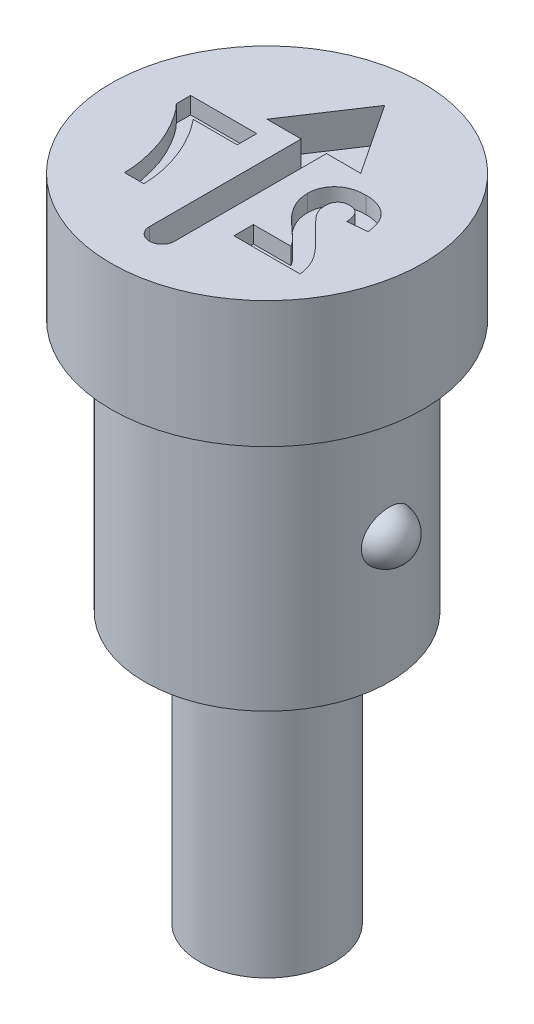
ISO-10303-21;
HEADER;
FILE_DESCRIPTION(('STEP AP214'),'2;1');
FILE_NAME('part.step','',(''),(''),'','','');
FILE_SCHEMA(('AUTOMOTIVE_DESIGN { 1 0 10303 214 1 1 1 1 }'));
ENDSEC;
DATA;
#1=APPLICATION_CONTEXT('core data for automotive mechanical design processes');
#2=APPLICATION_PROTOCOL_DEFINITION('international standard','automotive_design',2000,#1);
#3=PRODUCT_CONTEXT('',#1,'mechanical');
#4=PRODUCT('Part','Part','',(#3));
#5=PRODUCT_RELATED_PRODUCT_CATEGORY('part','',(#4));
#6=PRODUCT_DEFINITION_FORMATION('','',#4);
#7=PRODUCT_DEFINITION_CONTEXT('part definition',#1,'design');
#8=PRODUCT_DEFINITION('design','',#6,#7);
#9=PRODUCT_DEFINITION_SHAPE('','',#8);
#10=(LENGTH_UNIT() NAMED_UNIT(*) SI_UNIT(.MILLI.,.METRE.));
#11=(NAMED_UNIT(*) PLANE_ANGLE_UNIT() SI_UNIT($,.RADIAN.));
#12=(NAMED_UNIT(*) SI_UNIT($,.STERADIAN.) SOLID_ANGLE_UNIT());
#13=UNCERTAINTY_MEASURE_WITH_UNIT(LENGTH_MEASURE(1.E-05),#10,'distance_accuracy_value','');
#14=(GEOMETRIC_REPRESENTATION_CONTEXT(3) GLOBAL_UNCERTAINTY_ASSIGNED_CONTEXT((#13)) GLOBAL_UNIT_ASSIGNED_CONTEXT((#10,
#11,#12)) REPRESENTATION_CONTEXT('',''));
#15=CARTESIAN_POINT('',(0.,0.,0.));
#16=DIRECTION('',(0.,0.,1.));
#17=DIRECTION('',(1.,0.,0.));
#18=AXIS2_PLACEMENT_3D('',#15,#16,#17);
#19=CARTESIAN_POINT('',(0.,0.,0.));
#20=DIRECTION('',(0.,1.,0.));
#21=DIRECTION('',(0.,0.,1.));
#22=AXIS2_PLACEMENT_3D('',#19,#20,#21);
#23=CYLINDRICAL_SURFACE('',#22,1.45);
#24=CARTESIAN_POINT('',(0.,-1.5,0.));
#25=DIRECTION('',(0.,1.,0.));
#26=DIRECTION('',(0.,0.,1.));
#27=AXIS2_PLACEMENT_3D('',#24,#25,#26);
#28=CIRCLE('',#27,1.45);
#29=CARTESIAN_POINT('',(0.,-1.5,1.45));
#30=VERTEX_POINT('',#29);
#31=EDGE_CURVE('E416',#30,#30,#28,.T.);
#32=ORIENTED_EDGE('',*,*,#31,.F.);
#33=EDGE_LOOP('',(#32));
#34=FACE_BOUND('',#33,.T.);
#35=CARTESIAN_POINT('',(0.,-4.5,0.));
#36=DIRECTION('',(0.,1.,0.));
#37=DIRECTION('',(0.,0.,1.));
#38=AXIS2_PLACEMENT_3D('',#35,#36,#37);
#39=CIRCLE('',#38,1.45);
#40=CARTESIAN_POINT('',(0.,-4.5,1.45));
#41=VERTEX_POINT('',#40);
#42=EDGE_CURVE('E413',#41,#41,#39,.T.);
#43=ORIENTED_EDGE('',*,*,#42,.T.);
#44=EDGE_LOOP('',(#43));
#45=FACE_BOUND('',#44,.T.);
#46=CARTESIAN_POINT('',(1.4186910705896,-3.,-0.299692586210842));
#47=CARTESIAN_POINT('',(1.4186913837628,-3.01642766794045,-0.299692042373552));
#48=CARTESIAN_POINT('',(1.41898217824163,-3.03286255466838,-0.298324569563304));
#49=CARTESIAN_POINT('',(1.42011330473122,-3.06526877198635,-0.292891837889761));
#50=CARTESIAN_POINT('',(1.42095404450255,-3.08123974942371,-0.288824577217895));
#51=CARTESIAN_POINT('',(1.42308895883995,-3.11224685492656,-0.278114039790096));
#52=CARTESIAN_POINT('',(1.42438277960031,-3.12728370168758,-0.271472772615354));
#53=CARTESIAN_POINT('',(1.42727969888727,-3.15602173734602,-0.255804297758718));
#54=CARTESIAN_POINT('',(1.42888276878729,-3.16972304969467,-0.246777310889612));
#55=CARTESIAN_POINT('',(1.43223858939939,-3.19555107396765,-0.226492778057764));
#56=CARTESIAN_POINT('',(1.43399260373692,-3.20766180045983,-0.21521509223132));
#57=CARTESIAN_POINT('',(1.43744518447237,-3.22984040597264,-0.190796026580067));
#58=CARTESIAN_POINT('',(1.43914374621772,-3.23990811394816,-0.177654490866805));
#59=CARTESIAN_POINT('',(1.44232287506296,-3.25786170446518,-0.149683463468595));
#60=CARTESIAN_POINT('',(1.44380026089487,-3.26571696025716,-0.134833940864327));
#61=CARTESIAN_POINT('',(1.44634762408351,-3.27886307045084,-0.104007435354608));
#62=CARTESIAN_POINT('',(1.44741759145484,-3.28415386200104,-0.0880304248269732));
#63=CARTESIAN_POINT('',(1.44903640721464,-3.29204977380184,-0.0553370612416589));
#64=CARTESIAN_POINT('',(1.44958330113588,-3.29464482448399,-0.0386181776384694));
#65=CARTESIAN_POINT('',(1.45008906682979,-3.29704709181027,-0.00497262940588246));
#66=CARTESIAN_POINT('',(1.45004794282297,-3.29685432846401,0.0119540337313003));
#67=CARTESIAN_POINT('',(1.44938267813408,-3.29368829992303,0.0455096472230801));
#68=CARTESIAN_POINT('',(1.44875935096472,-3.29071891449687,0.0621389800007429));
#69=CARTESIAN_POINT('',(1.4469989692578,-3.2820817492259,0.0946530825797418));
#70=CARTESIAN_POINT('',(1.44586190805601,-3.27641393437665,0.110537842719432));
#71=CARTESIAN_POINT('',(1.4431976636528,-3.26252075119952,0.14112620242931));
#72=CARTESIAN_POINT('',(1.44167017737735,-3.25429339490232,0.155828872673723));
#73=CARTESIAN_POINT('',(1.4383942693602,-3.23549626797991,0.183624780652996));
#74=CARTESIAN_POINT('',(1.43664584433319,-3.22492646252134,0.196717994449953));
#75=CARTESIAN_POINT('',(1.43312337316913,-3.20172334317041,0.220923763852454));
#76=CARTESIAN_POINT('',(1.43134932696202,-3.18909002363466,0.232036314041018));
#77=CARTESIAN_POINT('',(1.42797694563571,-3.16210218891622,0.251960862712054));
#78=CARTESIAN_POINT('',(1.42637860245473,-3.14774775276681,0.260772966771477));
#79=CARTESIAN_POINT('',(1.42355497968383,-3.11785498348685,0.275770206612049));
#80=CARTESIAN_POINT('',(1.4223264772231,-3.10232844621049,0.281978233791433));
#81=CARTESIAN_POINT('',(1.42036540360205,-3.07042323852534,0.291696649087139));
#82=CARTESIAN_POINT('',(1.41963278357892,-3.05404465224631,0.295207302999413));
#83=CARTESIAN_POINT('',(1.41875581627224,-3.02116716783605,0.299393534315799));
#84=CARTESIAN_POINT('',(1.41860270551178,-3.00467387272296,0.300111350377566));
#85=CARTESIAN_POINT('',(1.41887789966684,-2.97180141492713,0.298807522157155));
#86=CARTESIAN_POINT('',(1.41930617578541,-2.95542224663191,0.296786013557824));
#87=CARTESIAN_POINT('',(1.42069046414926,-2.92335614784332,0.290086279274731));
#88=CARTESIAN_POINT('',(1.42164291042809,-2.90766530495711,0.285425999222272));
#89=CARTESIAN_POINT('',(1.42396678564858,-2.87729379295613,0.27359587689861));
#90=CARTESIAN_POINT('',(1.4253382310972,-2.86261316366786,0.266425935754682));
#91=CARTESIAN_POINT('',(1.42836317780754,-2.83453091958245,0.249702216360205));
#92=CARTESIAN_POINT('',(1.43001910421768,-2.82114199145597,0.240127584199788));
#93=CARTESIAN_POINT('',(1.43342274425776,-2.79614744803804,0.218893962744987));
#94=CARTESIAN_POINT('',(1.43517046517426,-2.78454197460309,0.207234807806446));
#95=CARTESIAN_POINT('',(1.43859459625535,-2.76325392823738,0.181962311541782));
#96=CARTESIAN_POINT('',(1.44026954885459,-2.75360271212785,0.168322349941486));
#97=CARTESIAN_POINT('',(1.44333620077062,-2.73669380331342,0.139602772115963));
#98=CARTESIAN_POINT('',(1.44472788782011,-2.72943621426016,0.124523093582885));
#99=CARTESIAN_POINT('',(1.44708571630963,-2.71745483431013,0.0932246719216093));
#100=CARTESIAN_POINT('',(1.44804854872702,-2.71275068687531,0.0769981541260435));
#101=CARTESIAN_POINT('',(1.44942741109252,-2.7060828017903,0.0439690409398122));
#102=CARTESIAN_POINT('',(1.4498434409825,-2.70411906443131,0.0271664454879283));
#103=CARTESIAN_POINT('',(1.45008312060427,-2.7029829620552,-0.00652819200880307));
#104=CARTESIAN_POINT('',(1.44990708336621,-2.70380912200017,-0.0234201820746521));
#105=CARTESIAN_POINT('',(1.44898255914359,-2.70822825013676,-0.0568222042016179));
#106=CARTESIAN_POINT('',(1.44823407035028,-2.71182122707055,-0.073332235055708));
#107=CARTESIAN_POINT('',(1.44624695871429,-2.72167930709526,-0.105496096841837));
#108=CARTESIAN_POINT('',(1.44500852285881,-2.72794339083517,-0.12115025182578));
#109=CARTESIAN_POINT('',(1.44217747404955,-2.74298170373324,-0.1511676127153));
#110=CARTESIAN_POINT('',(1.44058486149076,-2.75175593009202,-0.165530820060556));
#111=CARTESIAN_POINT('',(1.43721942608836,-2.77159871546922,-0.192578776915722));
#112=CARTESIAN_POINT('',(1.43544637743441,-2.7826701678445,-0.205261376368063));
#113=CARTESIAN_POINT('',(1.43192043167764,-2.80680890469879,-0.228567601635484));
#114=CARTESIAN_POINT('',(1.43016753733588,-2.81987645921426,-0.239190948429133));
#115=CARTESIAN_POINT('',(1.42688968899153,-2.84758345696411,-0.258025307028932));
#116=CARTESIAN_POINT('',(1.42536371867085,-2.86221535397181,-0.266247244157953));
#117=CARTESIAN_POINT('',(1.42270703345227,-2.89268295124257,-0.28009787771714));
#118=CARTESIAN_POINT('',(1.42157598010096,-2.90851760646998,-0.28572879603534));
#119=CARTESIAN_POINT('',(1.42005053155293,-2.93698172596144,-0.293201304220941));
#120=CARTESIAN_POINT('',(1.41954387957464,-2.94945415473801,-0.295631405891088));
#121=CARTESIAN_POINT('',(1.41886403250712,-2.97461628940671,-0.298877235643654));
#122=CARTESIAN_POINT('',(1.41869082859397,-2.9873059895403,-0.299693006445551));
#123=CARTESIAN_POINT('',(1.4186910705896,-3.,-0.299692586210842));
#124=B_SPLINE_CURVE_WITH_KNOTS('',3,(#46,#47,#48,#49,#50,#51,#52,#53,#54,#55,#56,#57,#58,#59,
#60,#61,#62,#63,#64,#65,#66,#67,#68,#69,#70,#71,#72,#73,#74,#75,#76,#77,#78,#79,#80,#81,#82,#83,
#84,#85,#86,#87,#88,#89,#90,#91,#92,#93,#94,#95,#96,#97,#98,#99,#100,#101,#102,#103,#104,#105,
#106,#107,#108,#109,#110,#111,#112,#113,#114,#115,#116,#117,#118,#119,#120,#121,#122,#123),
.UNSPECIFIED.,.T.,.F.,(4,2,2,2,2,2,2,2,2,2,2,2,2,2,2,2,2,2,2,2,2,2,2,2,2,2,2,2,2,2,2,2,2,2,2,2,
2,2,4),(0.,0.0492367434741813,0.0985100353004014,0.147744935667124,0.196975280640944,
0.246667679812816,0.296364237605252,0.34671826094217,0.397073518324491,0.447616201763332,
0.49815852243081,0.548630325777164,0.599102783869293,0.649614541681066,0.700127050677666,
0.750639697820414,0.801150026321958,0.851206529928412,0.901258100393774,0.950549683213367,
0.9998388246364,1.04879672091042,1.09775654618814,1.14715657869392,1.19656053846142,
1.24670342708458,1.29684848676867,1.34737403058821,1.397899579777,1.44839841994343,
1.4988974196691,1.54937716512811,1.59985685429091,1.65040051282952,1.70095101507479,
1.75126781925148,1.80154139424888,1.83958868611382,1.87763497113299),.UNSPECIFIED.);
#125=CARTESIAN_POINT('',(1.4186910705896,-3.,-0.299692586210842));
#126=VERTEX_POINT('',#125);
#127=EDGE_CURVE('E41',#126,#126,#124,.T.);
#128=ORIENTED_EDGE('',*,*,#127,.T.);
#129=EDGE_LOOP('',(#128));
#130=FACE_BOUND('',#129,.T.);
#131=ADVANCED_FACE('F37',(#34,#45,#130),#23,.T.);
#132=CARTESIAN_POINT('',(0.,0.,0.));
#133=DIRECTION('',(0.,1.,0.));
#134=DIRECTION('',(0.,0.,1.));
#135=AXIS2_PLACEMENT_3D('',#132,#133,#134);
#136=PLANE('',#135);
#137=DIRECTION('',(-1.,0.,0.));
#138=VECTOR('',#137,1.);
#139=CARTESIAN_POINT('',(0.891219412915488,0.,0.60732576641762));
#140=LINE('',#139,#138);
#141=CARTESIAN_POINT('',(0.891219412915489,0.,0.60732576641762));
#142=VERTEX_POINT('',#141);
#143=CARTESIAN_POINT('',(0.445305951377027,0.,0.60732576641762));
#144=VERTEX_POINT('',#143);
#145=EDGE_CURVE('E58',#142,#144,#140,.T.);
#146=ORIENTED_EDGE('',*,*,#145,.F.);
#147=CARTESIAN_POINT('',(0.561652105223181,0.,0.265498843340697));
#148=CARTESIAN_POINT('',(0.565302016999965,0.,0.270095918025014));
#149=CARTESIAN_POINT('',(0.573119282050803,0.,0.279941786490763));
#150=CARTESIAN_POINT('',(0.586418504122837,0.,0.29503890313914));
#151=CARTESIAN_POINT('',(0.601831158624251,0.,0.311529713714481));
#152=CARTESIAN_POINT('',(0.619139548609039,0.,0.329722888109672));
#153=CARTESIAN_POINT('',(0.638915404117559,0.,0.348974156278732));
#154=CARTESIAN_POINT('',(0.660447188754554,0.,0.370088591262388));
#155=CARTESIAN_POINT('',(0.68468236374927,0.,0.391986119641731));
#156=CARTESIAN_POINT('',(0.709784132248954,0.,0.415212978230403));
#157=CARTESIAN_POINT('',(0.734995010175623,0.,0.43781935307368));
#158=CARTESIAN_POINT('',(0.758167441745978,0.,0.459290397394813));
#159=CARTESIAN_POINT('',(0.779215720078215,0.,0.47828766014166));
#160=CARTESIAN_POINT('',(0.797159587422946,0.,0.495859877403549));
#161=CARTESIAN_POINT('',(0.813054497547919,0.,0.510807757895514));
#162=CARTESIAN_POINT('',(0.826327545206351,0.,0.523897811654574));
#163=CARTESIAN_POINT('',(0.837227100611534,0.,0.534813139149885));
#164=CARTESIAN_POINT('',(0.852245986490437,0.,0.551827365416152));
#165=CARTESIAN_POINT('',(0.871355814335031,0.,0.574839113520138));
#166=CARTESIAN_POINT('',(0.884800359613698,0.,0.596827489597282));
#167=CARTESIAN_POINT('',(0.891219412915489,0.,0.60732576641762));
#168=B_SPLINE_CURVE_WITH_KNOTS('',3,(#147,#148,#149,#150,#151,#152,#153,#154,#155,#156,#157,
#158,#159,#160,#161,#162,#163,#164,#165,#166,#167),.UNSPECIFIED.,.F.,.F.,(4,1,1,1,1,1,1,1,1,1,1,
1,1,1,1,1,1,1,4),(0.,0.0369753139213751,0.0791925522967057,0.126700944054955,0.179184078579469,
0.237368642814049,0.300558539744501,0.369153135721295,0.443112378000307,0.516018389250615,
0.582473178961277,0.642136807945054,0.694619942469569,0.740679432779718,0.779589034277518,
0.812073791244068,0.837814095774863,0.922564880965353,1.),.UNSPECIFIED.);
#169=CARTESIAN_POINT('',(0.561652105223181,0.,0.265498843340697));
#170=VERTEX_POINT('',#169);
#171=EDGE_CURVE('E243',#170,#142,#168,.T.);
#172=ORIENTED_EDGE('',*,*,#171,.F.);
#173=CARTESIAN_POINT('',(0.445305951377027,0.,-0.0354626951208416));
#174=CARTESIAN_POINT('',(0.445599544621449,0.,-0.02238214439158));
#175=CARTESIAN_POINT('',(0.446181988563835,0.,0.00356766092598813));
#176=CARTESIAN_POINT('',(0.451758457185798,0.,0.0419292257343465));
#177=CARTESIAN_POINT('',(0.460278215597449,0.,0.0794061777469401));
#178=CARTESIAN_POINT('',(0.472869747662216,0.,0.116090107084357));
#179=CARTESIAN_POINT('',(0.488830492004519,0.,0.152860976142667));
#180=CARTESIAN_POINT('',(0.509404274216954,0.,0.189801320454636));
#181=CARTESIAN_POINT('',(0.533291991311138,0.,0.228025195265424));
#182=CARTESIAN_POINT('',(0.551995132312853,0.,0.25273859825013));
#183=CARTESIAN_POINT('',(0.561652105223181,0.,0.265498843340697));
#184=B_SPLINE_CURVE_WITH_KNOTS('',3,(#173,#174,#175,#176,#177,#178,#179,#180,#181,#182,#183),
.UNSPECIFIED.,.F.,.F.,(4,1,1,1,1,1,1,1,4),(0.,0.119176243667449,0.236427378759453,
0.352663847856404,0.469086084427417,0.58946290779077,0.717601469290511,0.854189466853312,1.),.UNSPECIFIED.);
#185=CARTESIAN_POINT('',(0.445305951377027,0.,-0.0354626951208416));
#186=VERTEX_POINT('',#185);
#187=EDGE_CURVE('E246',#186,#170,#184,.T.);
#188=ORIENTED_EDGE('',*,*,#187,.F.);
#189=CARTESIAN_POINT('',(0.813575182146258,0.,-0.361905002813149));
#190=CARTESIAN_POINT('',(0.799622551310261,0.,-0.361636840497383));
#191=CARTESIAN_POINT('',(0.772448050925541,0.,-0.361114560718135));
#192=CARTESIAN_POINT('',(0.732778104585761,0.,-0.356801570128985));
#193=CARTESIAN_POINT('',(0.695511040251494,0.,-0.349281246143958));
#194=CARTESIAN_POINT('',(0.660321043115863,0.,-0.339319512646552));
#195=CARTESIAN_POINT('',(0.627569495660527,0.,-0.326019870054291));
#196=CARTESIAN_POINT('',(0.596983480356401,0.,-0.30994115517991));
#197=CARTESIAN_POINT('',(0.569044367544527,0.,-0.29047314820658));
#198=CARTESIAN_POINT('',(0.543335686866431,0.,-0.268677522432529));
#199=CARTESIAN_POINT('',(0.520354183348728,0.,-0.244709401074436));
#200=CARTESIAN_POINT('',(0.500224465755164,0.,-0.21914334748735));
#201=CARTESIAN_POINT('',(0.483359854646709,0.,-0.191997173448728));
#202=CARTESIAN_POINT('',(0.469207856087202,0.,-0.163601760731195));
#203=CARTESIAN_POINT('',(0.458700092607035,0.,-0.133500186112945));
#204=CARTESIAN_POINT('',(0.451043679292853,0.,-0.102108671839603));
#205=CARTESIAN_POINT('',(0.445967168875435,0.,-0.0692807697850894));
#206=CARTESIAN_POINT('',(0.445528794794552,0.,-0.0468600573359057));
#207=CARTESIAN_POINT('',(0.445305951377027,0.,-0.0354626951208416));
#208=B_SPLINE_CURVE_WITH_KNOTS('',3,(#189,#190,#191,#192,#193,#194,#195,#196,#197,#198,#199,
#200,#201,#202,#203,#204,#205,#206,#207),.UNSPECIFIED.,.F.,.F.,(4,1,1,1,1,1,1,1,1,1,1,1,1,1,1,1,
4),(0.,0.0756723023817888,0.147381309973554,0.216084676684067,0.28169803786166,
0.345459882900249,0.407485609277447,0.468731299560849,0.529782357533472,0.590032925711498,
0.648548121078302,0.70595351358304,0.763101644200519,0.820289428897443,0.878479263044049,
0.938226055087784,1.),.UNSPECIFIED.);
#209=CARTESIAN_POINT('',(0.813575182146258,0.,-0.361905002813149));
#210=VERTEX_POINT('',#209);
#211=EDGE_CURVE('E552',#210,#186,#208,.T.);
#212=ORIENTED_EDGE('',*,*,#211,.F.);
#213=CARTESIAN_POINT('',(1.19915210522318,0.,0.00011422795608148));
#214=CARTESIAN_POINT('',(1.19729675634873,0.,-0.0154656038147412));
#215=CARTESIAN_POINT('',(1.19369953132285,0.,-0.0456724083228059));
#216=CARTESIAN_POINT('',(1.18472259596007,0.,-0.089059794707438));
#217=CARTESIAN_POINT('',(1.17335363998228,0.,-0.129086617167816));
#218=CARTESIAN_POINT('',(1.15905066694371,0.,-0.165678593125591));
#219=CARTESIAN_POINT('',(1.14240483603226,0.,-0.19906841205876));
#220=CARTESIAN_POINT('',(1.12256707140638,0.,-0.228755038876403));
#221=CARTESIAN_POINT('',(1.10023052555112,0.,-0.255067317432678));
#222=CARTESIAN_POINT('',(1.07537589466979,0.,-0.2779912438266));
#223=CARTESIAN_POINT('',(1.04816118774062,0.,-0.297599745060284));
#224=CARTESIAN_POINT('',(1.01960423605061,0.,-0.315103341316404));
#225=CARTESIAN_POINT('',(0.98914695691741,0.,-0.32946185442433));
#226=CARTESIAN_POINT('',(0.957124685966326,0.,-0.341295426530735));
#227=CARTESIAN_POINT('',(0.923551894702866,0.,-0.350752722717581));
#228=CARTESIAN_POINT('',(0.888273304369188,0.,-0.357005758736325));
#229=CARTESIAN_POINT('',(0.851506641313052,0.,-0.361404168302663));
#230=CARTESIAN_POINT('',(0.826409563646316,0.,-0.361735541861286));
#231=CARTESIAN_POINT('',(0.813575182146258,0.,-0.361905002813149));
#232=B_SPLINE_CURVE_WITH_KNOTS('',3,(#213,#214,#215,#216,#217,#218,#219,#220,#221,#222,#223,
#224,#225,#226,#227,#228,#229,#230,#231),.UNSPECIFIED.,.F.,.F.,(4,1,1,1,1,1,1,1,1,1,1,1,1,1,1,1,
4),(0.,0.0794357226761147,0.154013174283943,0.224141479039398,0.289934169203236,
0.352732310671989,0.412725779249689,0.470302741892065,0.527168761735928,0.583502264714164,
0.639948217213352,0.696584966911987,0.753726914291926,0.812707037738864,0.872963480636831,
0.93503486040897,1.),.UNSPECIFIED.);
#233=CARTESIAN_POINT('',(1.19915210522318,0.,0.00011422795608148));
#234=VERTEX_POINT('',#233);
#235=EDGE_CURVE('E560',#234,#210,#232,.T.);
#236=ORIENTED_EDGE('',*,*,#235,.F.);
#237=DIRECTION('',(0.995240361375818,0.,-0.0974506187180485));
#238=VECTOR('',#237,1.);
#239=CARTESIAN_POINT('',(0.96838287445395,0.,0.0227103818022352));
#240=LINE('',#239,#238);
#241=CARTESIAN_POINT('',(0.96838287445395,0.,0.0227103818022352));
#242=VERTEX_POINT('',#241);
#243=EDGE_CURVE('E568',#242,#234,#240,.T.);
#244=ORIENTED_EDGE('',*,*,#243,.F.);
#245=CARTESIAN_POINT('',(0.81838287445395,0.,-0.161905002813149));
#246=CARTESIAN_POINT('',(0.82884955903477,0.,-0.161430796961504));
#247=CARTESIAN_POINT('',(0.849068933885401,0.,-0.160514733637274));
#248=CARTESIAN_POINT('',(0.877805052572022,0.,-0.152512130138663));
#249=CARTESIAN_POINT('',(0.90294385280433,0.,-0.138658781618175));
#250=CARTESIAN_POINT('',(0.920859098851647,0.,-0.122871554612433));
#251=CARTESIAN_POINT('',(0.932961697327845,0.,-0.107519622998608));
#252=CARTESIAN_POINT('',(0.941207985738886,0.,-0.0941414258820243));
#253=CARTESIAN_POINT('',(0.948315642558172,0.,-0.0789396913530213));
#254=CARTESIAN_POINT('',(0.95461361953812,0.,-0.0620855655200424));
#255=CARTESIAN_POINT('',(0.959588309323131,0.,-0.0433859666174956));
#256=CARTESIAN_POINT('',(0.963594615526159,0.,-0.0229833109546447));
#257=CARTESIAN_POINT('',(0.96682311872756,0.,-0.000767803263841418));
#258=CARTESIAN_POINT('',(0.967849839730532,0.,0.0146868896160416));
#259=CARTESIAN_POINT('',(0.96838287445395,0.,0.0227103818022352));
#260=B_SPLINE_CURVE_WITH_KNOTS('',3,(#245,#246,#247,#248,#249,#250,#251,#252,#253,#254,#255,
#256,#257,#258,#259),.UNSPECIFIED.,.F.,.F.,(4,1,1,1,1,1,1,1,1,1,1,1,4),(0.,0.116899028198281,
0.225823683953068,0.330086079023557,0.435451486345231,0.490306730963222,0.54824405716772,
0.610766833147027,0.677675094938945,0.749188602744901,0.826858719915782,0.910111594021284,1.),.UNSPECIFIED.);
#261=CARTESIAN_POINT('',(0.81838287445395,0.,-0.161905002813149));
#262=VERTEX_POINT('',#261);
#263=EDGE_CURVE('E574',#262,#242,#260,.T.);
#264=ORIENTED_EDGE('',*,*,#263,.F.);
#265=CARTESIAN_POINT('',(0.676075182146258,0.,-0.00445307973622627));
#266=CARTESIAN_POINT('',(0.676507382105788,0.,-0.0164259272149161));
#267=CARTESIAN_POINT('',(0.67732507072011,0.,-0.0390776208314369));
#268=CARTESIAN_POINT('',(0.684181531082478,0.,-0.0710433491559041));
#269=CARTESIAN_POINT('',(0.696340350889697,0.,-0.0985224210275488));
#270=CARTESIAN_POINT('',(0.713080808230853,0.,-0.121599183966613));
#271=CARTESIAN_POINT('',(0.734249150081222,0.,-0.139679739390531));
#272=CARTESIAN_POINT('',(0.758995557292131,0.,-0.15303951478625));
#273=CARTESIAN_POINT('',(0.787682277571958,0.,-0.160425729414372));
#274=CARTESIAN_POINT('',(0.807844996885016,0.,-0.161397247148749));
#275=CARTESIAN_POINT('',(0.81838287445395,0.,-0.161905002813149));
#276=B_SPLINE_CURVE_WITH_KNOTS('',3,(#265,#266,#267,#268,#269,#270,#271,#272,#273,#274,#275),
.UNSPECIFIED.,.F.,.F.,(4,1,1,1,1,1,1,1,4),(0.,0.149140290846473,0.282161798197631,
0.404655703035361,0.521109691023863,0.634416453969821,0.748796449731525,0.868710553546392,1.),.UNSPECIFIED.);
#277=CARTESIAN_POINT('',(0.676075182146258,0.,-0.00445307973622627));
#278=VERTEX_POINT('',#277);
#279=EDGE_CURVE('E579',#278,#262,#276,.T.);
#280=ORIENTED_EDGE('',*,*,#279,.F.);
#281=CARTESIAN_POINT('',(0.721748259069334,0.,0.134248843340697));
#282=CARTESIAN_POINT('',(0.71480031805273,0.,0.122707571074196));
#283=CARTESIAN_POINT('',(0.70139854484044,0.,0.100445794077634));
#284=CARTESIAN_POINT('',(0.686702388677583,0.,0.0654387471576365));
#285=CARTESIAN_POINT('',(0.67788120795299,0.,0.0304389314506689));
#286=CARTESIAN_POINT('',(0.67667070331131,0.,0.00705225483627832));
#287=CARTESIAN_POINT('',(0.676075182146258,0.,-0.00445307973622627));
#288=B_SPLINE_CURVE_WITH_KNOTS('',3,(#281,#282,#283,#284,#285,#286,#287),.UNSPECIFIED.,.F.,.F.,
(4,1,1,1,4),(0.,0.272795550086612,0.526191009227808,0.766904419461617,1.),.UNSPECIFIED.);
#289=CARTESIAN_POINT('',(0.721748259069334,0.,0.134248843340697));
#290=VERTEX_POINT('',#289);
#291=EDGE_CURVE('E587',#290,#278,#288,.T.);
#292=ORIENTED_EDGE('',*,*,#291,.F.);
#293=CARTESIAN_POINT('',(0.905402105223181,0.,0.327998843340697));
#294=CARTESIAN_POINT('',(0.893537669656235,0.,0.316546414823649));
#295=CARTESIAN_POINT('',(0.870951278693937,0.,0.294744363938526));
#296=CARTESIAN_POINT('',(0.838788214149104,0.,0.263524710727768));
#297=CARTESIAN_POINT('',(0.810513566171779,0.,0.234824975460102));
#298=CARTESIAN_POINT('',(0.78553615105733,0.,0.209388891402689));
#299=CARTESIAN_POINT('',(0.764432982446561,0.,0.186568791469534));
#300=CARTESIAN_POINT('',(0.746926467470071,0.,0.166723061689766));
#301=CARTESIAN_POINT('',(0.732794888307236,0.,0.149770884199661));
#302=CARTESIAN_POINT('',(0.725141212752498,0.,0.139016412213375));
#303=CARTESIAN_POINT('',(0.721748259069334,0.,0.134248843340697));
#304=B_SPLINE_CURVE_WITH_KNOTS('',3,(#293,#294,#295,#296,#297,#298,#299,#300,#301,#302,#303),
.UNSPECIFIED.,.F.,.F.,(4,1,1,1,1,1,1,1,4),(0.,0.18509006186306,0.352356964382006,
0.503079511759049,0.637279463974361,0.752473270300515,0.851885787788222,0.934339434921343,1.),.UNSPECIFIED.);
#305=CARTESIAN_POINT('',(0.905402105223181,0.,0.327998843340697));
#306=VERTEX_POINT('',#305);
#307=EDGE_CURVE('E595',#306,#290,#304,.T.);
#308=ORIENTED_EDGE('',*,*,#307,.F.);
#309=CARTESIAN_POINT('',(1.22992133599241,0.,0.838094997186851));
#310=CARTESIAN_POINT('',(1.22726481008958,0.,0.818372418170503));
#311=CARTESIAN_POINT('',(1.22195324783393,0.,0.778938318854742));
#312=CARTESIAN_POINT('',(1.20553179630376,0.,0.721335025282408));
#313=CARTESIAN_POINT('',(1.1836147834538,0.,0.665124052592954));
#314=CARTESIAN_POINT('',(1.15982802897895,0.,0.619381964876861));
#315=CARTESIAN_POINT('',(1.13616946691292,0.,0.582561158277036));
#316=CARTESIAN_POINT('',(1.11470405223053,0.,0.552389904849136));
#317=CARTESIAN_POINT('',(1.08909660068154,0.,0.520288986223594));
#318=CARTESIAN_POINT('',(1.05971870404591,0.,0.485999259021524));
#319=CARTESIAN_POINT('',(1.02673271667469,0.,0.449413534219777));
#320=CARTESIAN_POINT('',(0.989892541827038,0.,0.410667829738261));
#321=CARTESIAN_POINT('',(0.949022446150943,0.,0.36994763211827));
#322=CARTESIAN_POINT('',(0.920269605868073,0.,0.342296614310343));
#323=CARTESIAN_POINT('',(0.905402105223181,0.,0.327998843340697));
#324=B_SPLINE_CURVE_WITH_KNOTS('',3,(#309,#310,#311,#312,#313,#314,#315,#316,#317,#318,#319,
#320,#321,#322,#323),.UNSPECIFIED.,.F.,.F.,(4,1,1,1,1,1,1,1,1,1,1,1,4),(0.,0.0963574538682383,
0.192660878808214,0.289454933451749,0.388479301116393,0.441921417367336,0.501521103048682,
0.567882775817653,0.640891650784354,0.72037065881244,0.806636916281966,0.900015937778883,1.),.UNSPECIFIED.);
#325=CARTESIAN_POINT('',(1.22992133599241,0.,0.838094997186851));
#326=VERTEX_POINT('',#325);
#327=EDGE_CURVE('E603',#326,#306,#324,.T.);
#328=ORIENTED_EDGE('',*,*,#327,.F.);
#329=DIRECTION('',(1.,0.,0.));
#330=VECTOR('',#329,1.);
#331=CARTESIAN_POINT('',(0.445305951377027,0.,0.838094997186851));
#332=LINE('',#331,#330);
#333=CARTESIAN_POINT('',(0.445305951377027,0.,0.838094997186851));
#334=VERTEX_POINT('',#333);
#335=EDGE_CURVE('E611',#334,#326,#332,.T.);
#336=ORIENTED_EDGE('',*,*,#335,.F.);
#337=DIRECTION('',(0.,0.,1.));
#338=VECTOR('',#337,1.);
#339=CARTESIAN_POINT('',(0.445305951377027,0.,0.60732576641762));
#340=LINE('',#339,#338);
#341=EDGE_CURVE('E617',#144,#334,#340,.T.);
#342=ORIENTED_EDGE('',*,*,#341,.F.);
#343=EDGE_LOOP('',(#146,#172,#188,#212,#236,#244,#264,#280,#292,#308,#328,#336,#342));
#344=FACE_BOUND('',#343,.T.);
#345=DIRECTION('',(1.,0.,0.));
#346=VECTOR('',#345,1.);
#347=CARTESIAN_POINT('',(-0.991857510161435,0.,-0.115751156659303));
#348=LINE('',#347,#346);
#349=CARTESIAN_POINT('',(-0.991857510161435,0.,-0.115751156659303));
#350=VERTEX_POINT('',#349);
#351=CARTESIAN_POINT('',(-0.468540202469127,0.,-0.115751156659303));
#352=VERTEX_POINT('',#351);
#353=EDGE_CURVE('E66',#350,#352,#348,.T.);
#354=ORIENTED_EDGE('',*,*,#353,.F.);
#355=CARTESIAN_POINT('',(-0.622386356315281,0.,0.838094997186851));
#356=CARTESIAN_POINT('',(-0.623157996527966,0.,0.817651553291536));
#357=CARTESIAN_POINT('',(-0.624709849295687,0.,0.776537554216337));
#358=CARTESIAN_POINT('',(-0.630516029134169,0.,0.714826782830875));
#359=CARTESIAN_POINT('',(-0.639635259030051,0.,0.65288622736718));
#360=CARTESIAN_POINT('',(-0.650961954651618,0.,0.590572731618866));
#361=CARTESIAN_POINT('',(-0.665916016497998,0.,0.528037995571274));
#362=CARTESIAN_POINT('',(-0.682983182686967,0.,0.46505037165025));
#363=CARTESIAN_POINT('',(-0.703657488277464,0.,0.40194627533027));
#364=CARTESIAN_POINT('',(-0.726832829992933,0.,0.338846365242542));
#365=CARTESIAN_POINT('',(-0.752417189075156,0.,0.276349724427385));
#366=CARTESIAN_POINT('',(-0.780300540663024,0.,0.215231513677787));
#367=CARTESIAN_POINT('',(-0.810410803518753,0.,0.155873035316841));
#368=CARTESIAN_POINT('',(-0.842356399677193,0.,0.0980657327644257));
#369=CARTESIAN_POINT('',(-0.876508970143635,0.,0.0419955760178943));
#370=CARTESIAN_POINT('',(-0.912894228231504,0.,-0.012276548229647));
#371=CARTESIAN_POINT('',(-0.950996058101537,0.,-0.0651432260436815));
#372=CARTESIAN_POINT('',(-0.978239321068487,0.,-0.0988846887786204));
#373=CARTESIAN_POINT('',(-0.991857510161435,0.,-0.115751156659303));
#374=B_SPLINE_CURVE_WITH_KNOTS('',3,(#355,#356,#357,#358,#359,#360,#361,#362,#363,#364,#365,
#366,#367,#368,#369,#370,#371,#372,#373),.UNSPECIFIED.,.F.,.F.,(4,1,1,1,1,1,1,1,1,1,1,1,1,1,1,1,
4),(0.,0.0589531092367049,0.118561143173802,0.178522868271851,0.239353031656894,
0.301026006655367,0.363773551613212,0.427382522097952,0.492333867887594,0.557475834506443,
0.621960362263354,0.685889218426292,0.749254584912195,0.812267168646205,0.875035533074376,
0.937533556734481,1.),.UNSPECIFIED.);
#375=CARTESIAN_POINT('',(-0.622386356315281,0.,0.838094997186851));
#376=VERTEX_POINT('',#375);
#377=EDGE_CURVE('E328',#376,#350,#374,.T.);
#378=ORIENTED_EDGE('',*,*,#377,.F.);
#379=DIRECTION('',(1.,0.,0.));
#380=VECTOR('',#379,1.);
#381=CARTESIAN_POINT('',(-0.853155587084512,0.,0.838094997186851));
#382=LINE('',#381,#380);
#383=CARTESIAN_POINT('',(-0.853155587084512,0.,0.838094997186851));
#384=VERTEX_POINT('',#383);
#385=EDGE_CURVE('E322',#384,#376,#382,.T.);
#386=ORIENTED_EDGE('',*,*,#385,.F.);
#387=CARTESIAN_POINT('',(-1.25315558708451,0.,-0.177289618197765));
#388=CARTESIAN_POINT('',(-1.24497056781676,0.,-0.168961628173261));
#389=CARTESIAN_POINT('',(-1.22814451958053,0.,-0.151841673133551));
#390=CARTESIAN_POINT('',(-1.20404285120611,0.,-0.123823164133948));
#391=CARTESIAN_POINT('',(-1.17958408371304,0.,-0.0934181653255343));
#392=CARTESIAN_POINT('',(-1.15527967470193,0.,-0.0602169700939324));
#393=CARTESIAN_POINT('',(-1.1303741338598,0.,-0.0247440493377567));
#394=CARTESIAN_POINT('',(-1.10596197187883,0.,0.0136805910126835));
#395=CARTESIAN_POINT('',(-1.08120257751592,0.,0.0545584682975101));
#396=CARTESIAN_POINT('',(-1.04786860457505,0.,0.112380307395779));
#397=CARTESIAN_POINT('',(-1.00890534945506,0.,0.187913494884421));
#398=CARTESIAN_POINT('',(-0.967684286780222,0.,0.281805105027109));
#399=CARTESIAN_POINT('',(-0.932565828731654,0.,0.378580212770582));
#400=CARTESIAN_POINT('',(-0.908518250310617,0.,0.461039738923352));
#401=CARTESIAN_POINT('',(-0.892270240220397,0.,0.527130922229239));
#402=CARTESIAN_POINT('',(-0.881654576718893,0.,0.575458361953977));
#403=CARTESIAN_POINT('',(-0.87271844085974,0.,0.622425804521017));
#404=CARTESIAN_POINT('',(-0.865448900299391,0.,0.668115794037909));
#405=CARTESIAN_POINT('',(-0.860023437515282,0.,0.7125491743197));
#406=CARTESIAN_POINT('',(-0.855736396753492,0.,0.755571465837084));
#407=CARTESIAN_POINT('',(-0.853621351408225,0.,0.797287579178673));
#408=CARTESIAN_POINT('',(-0.853309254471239,0.,0.824631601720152));
#409=CARTESIAN_POINT('',(-0.853155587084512,0.,0.838094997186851));
#410=B_SPLINE_CURVE_WITH_KNOTS('',3,(#387,#388,#389,#390,#391,#392,#393,#394,#395,#396,#397,
#398,#399,#400,#401,#402,#403,#404,#405,#406,#407,#408,#409),.UNSPECIFIED.,.F.,.F.,(4,1,1,1,1,1,
1,1,1,1,1,1,1,1,1,1,1,1,1,1,4),(0.,0.0314272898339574,0.0646054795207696,0.0994393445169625,
0.136456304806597,0.175351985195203,0.216100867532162,0.258977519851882,0.304007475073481,
0.395756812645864,0.487615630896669,0.579873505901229,0.672707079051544,0.718694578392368,
0.76307923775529,0.805893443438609,0.847386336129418,0.88760014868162,0.926386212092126,
0.963754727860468,1.),.UNSPECIFIED.);
#411=CARTESIAN_POINT('',(-1.25315558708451,0.,-0.177289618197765));
#412=VERTEX_POINT('',#411);
#413=EDGE_CURVE('E317',#412,#384,#410,.T.);
#414=ORIENTED_EDGE('',*,*,#413,.F.);
#415=DIRECTION('',(0.,0.,1.));
#416=VECTOR('',#415,1.);
#417=CARTESIAN_POINT('',(-1.25315558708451,0.,-0.346520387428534));
#418=LINE('',#417,#416);
#419=CARTESIAN_POINT('',(-1.25315558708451,0.,-0.346520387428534));
#420=VERTEX_POINT('',#419);
#421=EDGE_CURVE('E314',#420,#412,#418,.T.);
#422=ORIENTED_EDGE('',*,*,#421,.F.);
#423=DIRECTION('',(-1.,0.,0.));
#424=VECTOR('',#423,1.);
#425=CARTESIAN_POINT('',(-0.468540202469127,0.,-0.346520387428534));
#426=LINE('',#425,#424);
#427=CARTESIAN_POINT('',(-0.468540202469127,0.,-0.346520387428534));
#428=VERTEX_POINT('',#427);
#429=EDGE_CURVE('E311',#428,#420,#426,.T.);
#430=ORIENTED_EDGE('',*,*,#429,.F.);
#431=DIRECTION('',(0.,0.,-1.));
#432=VECTOR('',#431,1.);
#433=CARTESIAN_POINT('',(-0.468540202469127,0.,-0.115751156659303));
#434=LINE('',#433,#432);
#435=EDGE_CURVE('E308',#352,#428,#434,.T.);
#436=ORIENTED_EDGE('',*,*,#435,.F.);
#437=EDGE_LOOP('',(#354,#378,#386,#414,#422,#430,#436));
#438=FACE_BOUND('',#437,.T.);
#439=DIRECTION('',(-0.551936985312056,0.,-0.833885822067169));
#440=VECTOR('',#439,1.);
#441=CARTESIAN_POINT('',(0.555983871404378,0.,-0.555));
#442=LINE('',#441,#440);
#443=CARTESIAN_POINT('',(0.555983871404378,0.,-0.555));
#444=VERTEX_POINT('',#443);
#445=CARTESIAN_POINT('',(0.,0.,-1.395));
#446=VERTEX_POINT('',#445);
#447=EDGE_CURVE('E373',#444,#446,#442,.T.);
#448=ORIENTED_EDGE('',*,*,#447,.F.);
#449=DIRECTION('',(1.,0.,0.));
#450=VECTOR('',#449,1.);
#451=CARTESIAN_POINT('',(0.15,0.,-0.555));
#452=LINE('',#451,#450);
#453=CARTESIAN_POINT('',(0.15,0.,-0.555));
#454=VERTEX_POINT('',#453);
#455=EDGE_CURVE('E354',#454,#444,#452,.T.);
#456=ORIENTED_EDGE('',*,*,#455,.F.);
#457=DIRECTION('',(0.,0.,-1.));
#458=VECTOR('',#457,1.);
#459=CARTESIAN_POINT('',(0.150000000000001,0.,1.245));
#460=LINE('',#459,#458);
#461=CARTESIAN_POINT('',(0.15,0.,1.245));
#462=VERTEX_POINT('',#461);
#463=EDGE_CURVE('E388',#462,#454,#460,.T.);
#464=ORIENTED_EDGE('',*,*,#463,.F.);
#465=CARTESIAN_POINT('',(0.,0.,1.245));
#466=DIRECTION('',(0.,1.,0.));
#467=DIRECTION('',(0.,0.,1.));
#468=AXIS2_PLACEMENT_3D('',#465,#466,#467);
#469=CIRCLE('',#468,0.150000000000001);
#470=CARTESIAN_POINT('',(-0.15,0.,1.245));
#471=VERTEX_POINT('',#470);
#472=EDGE_CURVE('E385',#471,#462,#469,.T.);
#473=ORIENTED_EDGE('',*,*,#472,.F.);
#474=DIRECTION('',(0.,0.,1.));
#475=VECTOR('',#474,1.);
#476=CARTESIAN_POINT('',(-0.15,0.,-0.555));
#477=LINE('',#476,#475);
#478=CARTESIAN_POINT('',(-0.15,0.,-0.555));
#479=VERTEX_POINT('',#478);
#480=EDGE_CURVE('E382',#479,#471,#477,.T.);
#481=ORIENTED_EDGE('',*,*,#480,.F.);
#482=DIRECTION('',(1.,0.,0.));
#483=VECTOR('',#482,1.);
#484=CARTESIAN_POINT('',(-0.555983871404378,0.,-0.555));
#485=LINE('',#484,#483);
#486=CARTESIAN_POINT('',(-0.555983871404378,0.,-0.555));
#487=VERTEX_POINT('',#486);
#488=EDGE_CURVE('E379',#487,#479,#485,.T.);
#489=ORIENTED_EDGE('',*,*,#488,.F.);
#490=DIRECTION('',(-0.551936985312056,0.,0.833885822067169));
#491=VECTOR('',#490,1.);
#492=CARTESIAN_POINT('',(0.,0.,-1.395));
#493=LINE('',#492,#491);
#494=EDGE_CURVE('E375',#446,#487,#493,.T.);
#495=ORIENTED_EDGE('',*,*,#494,.F.);
#496=EDGE_LOOP('',(#448,#456,#464,#473,#481,#489,#495));
#497=FACE_BOUND('',#496,.T.);
#498=CARTESIAN_POINT('',(0.,0.,0.));
#499=DIRECTION('',(0.,1.,0.));
#500=DIRECTION('',(0.,0.,1.));
#501=AXIS2_PLACEMENT_3D('',#498,#499,#500);
#502=CIRCLE('',#501,1.85);
#503=CARTESIAN_POINT('',(0.,0.,1.85));
#504=VERTEX_POINT('',#503);
#505=EDGE_CURVE('E11',#504,#504,#502,.T.);
#506=ORIENTED_EDGE('',*,*,#505,.T.);
#507=EDGE_LOOP('',(#506));
#508=FACE_BOUND('',#507,.T.);
#509=ADVANCED_FACE('F39',(#344,#438,#497,#508),#136,.T.);
#510=CARTESIAN_POINT('',(0.,0.,0.));
#511=DIRECTION('',(0.,1.,0.));
#512=DIRECTION('',(0.,0.,1.));
#513=AXIS2_PLACEMENT_3D('',#510,#511,#512);
#514=CYLINDRICAL_SURFACE('',#513,1.85);
#515=CARTESIAN_POINT('',(0.,-1.5,0.));
#516=DIRECTION('',(0.,1.,0.));
#517=DIRECTION('',(0.,0.,1.));
#518=AXIS2_PLACEMENT_3D('',#515,#516,#517);
#519=CIRCLE('',#518,1.85);
#520=CARTESIAN_POINT('',(0.,-1.5,1.85));
#521=VERTEX_POINT('',#520);
#522=EDGE_CURVE('E51',#521,#521,#519,.T.);
#523=ORIENTED_EDGE('',*,*,#522,.T.);
#524=EDGE_LOOP('',(#523));
#525=FACE_BOUND('',#524,.T.);
#526=ORIENTED_EDGE('',*,*,#505,.F.);
#527=EDGE_LOOP('',(#526));
#528=FACE_BOUND('',#527,.T.);
#529=ADVANCED_FACE('F422',(#525,#528),#514,.T.);
#530=CARTESIAN_POINT('',(-1.85,-1.5,0.));
#531=DIRECTION('',(0.,-1.,0.));
#532=DIRECTION('',(0.,0.,-1.));
#533=AXIS2_PLACEMENT_3D('',#530,#531,#532);
#534=PLANE('',#533);
#535=ORIENTED_EDGE('',*,*,#31,.T.);
#536=EDGE_LOOP('',(#535));
#537=FACE_BOUND('',#536,.T.);
#538=ORIENTED_EDGE('',*,*,#522,.F.);
#539=EDGE_LOOP('',(#538));
#540=FACE_BOUND('',#539,.T.);
#541=ADVANCED_FACE('F425',(#537,#540),#534,.T.);
#542=CARTESIAN_POINT('',(-1.45,-4.5,0.));
#543=DIRECTION('',(0.,-1.,0.));
#544=DIRECTION('',(0.,0.,-1.));
#545=AXIS2_PLACEMENT_3D('',#542,#543,#544);
#546=PLANE('',#545);
#547=CARTESIAN_POINT('',(0.,-4.5,0.));
#548=DIRECTION('',(0.,1.,0.));
#549=DIRECTION('',(0.,0.,1.));
#550=AXIS2_PLACEMENT_3D('',#547,#548,#549);
#551=CIRCLE('',#550,0.799999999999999);
#552=CARTESIAN_POINT('',(0.,-4.5,0.799999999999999));
#553=VERTEX_POINT('',#552);
#554=EDGE_CURVE('E410',#553,#553,#551,.T.);
#555=ORIENTED_EDGE('',*,*,#554,.T.);
#556=EDGE_LOOP('',(#555));
#557=FACE_BOUND('',#556,.T.);
#558=ORIENTED_EDGE('',*,*,#42,.F.);
#559=EDGE_LOOP('',(#558));
#560=FACE_BOUND('',#559,.T.);
#561=ADVANCED_FACE('F427',(#557,#560),#546,.T.);
#562=CARTESIAN_POINT('',(0.,0.,0.));
#563=DIRECTION('',(0.,1.,0.));
#564=DIRECTION('',(0.,0.,1.));
#565=AXIS2_PLACEMENT_3D('',#562,#563,#564);
#566=CYLINDRICAL_SURFACE('',#565,0.799999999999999);
#567=CARTESIAN_POINT('',(0.,-7.7,0.));
#568=DIRECTION('',(0.,1.,0.));
#569=DIRECTION('',(0.,0.,1.));
#570=AXIS2_PLACEMENT_3D('',#567,#568,#569);
#571=CIRCLE('',#570,0.799999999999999);
#572=CARTESIAN_POINT('',(0.,-7.7,0.799999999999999));
#573=VERTEX_POINT('',#572);
#574=EDGE_CURVE('E395',#573,#573,#571,.T.);
#575=ORIENTED_EDGE('',*,*,#574,.T.);
#576=EDGE_LOOP('',(#575));
#577=FACE_BOUND('',#576,.T.);
#578=ORIENTED_EDGE('',*,*,#554,.F.);
#579=EDGE_LOOP('',(#578));
#580=FACE_BOUND('',#579,.T.);
#581=ADVANCED_FACE('F434',(#577,#580),#566,.T.);
#582=CARTESIAN_POINT('',(-0.799999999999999,-7.7,0.));
#583=DIRECTION('',(0.,-1.,0.));
#584=DIRECTION('',(0.,0.,-1.));
#585=AXIS2_PLACEMENT_3D('',#582,#583,#584);
#586=PLANE('',#585);
#587=ORIENTED_EDGE('',*,*,#574,.F.);
#588=EDGE_LOOP('',(#587));
#589=FACE_BOUND('',#588,.T.);
#590=ADVANCED_FACE('F449',(#589),#586,.T.);
#591=CARTESIAN_POINT('',(0.555983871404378,-0.4,-0.555));
#592=DIRECTION('',(0.833885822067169,0.,-0.551936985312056));
#593=DIRECTION('',(-0.551936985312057,0.,-0.833885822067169));
#594=AXIS2_PLACEMENT_3D('',#591,#592,#593);
#595=PLANE('',#594);
#596=ORIENTED_EDGE('',*,*,#447,.T.);
#597=DIRECTION('',(0.,1.,0.));
#598=VECTOR('',#597,1.);
#599=CARTESIAN_POINT('',(0.,-0.4,-1.395));
#600=LINE('',#599,#598);
#601=CARTESIAN_POINT('',(0.,-0.4,-1.395));
#602=VERTEX_POINT('',#601);
#603=EDGE_CURVE('E372',#602,#446,#600,.T.);
#604=ORIENTED_EDGE('',*,*,#603,.F.);
#605=DIRECTION('',(-0.551936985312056,0.,-0.833885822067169));
#606=VECTOR('',#605,1.);
#607=CARTESIAN_POINT('',(0.555983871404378,-0.4,-0.555));
#608=LINE('',#607,#606);
#609=CARTESIAN_POINT('',(0.555983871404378,-0.4,-0.555));
#610=VERTEX_POINT('',#609);
#611=EDGE_CURVE('E350',#610,#602,#608,.T.);
#612=ORIENTED_EDGE('',*,*,#611,.F.);
#613=DIRECTION('',(0.,1.,0.));
#614=VECTOR('',#613,1.);
#615=CARTESIAN_POINT('',(0.555983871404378,-0.4,-0.555));
#616=LINE('',#615,#614);
#617=EDGE_CURVE('E393',#610,#444,#616,.T.);
#618=ORIENTED_EDGE('',*,*,#617,.T.);
#619=EDGE_LOOP('',(#596,#604,#612,#618));
#620=FACE_BOUND('',#619,.T.);
#621=ADVANCED_FACE('F453',(#620),#595,.F.);
#622=CARTESIAN_POINT('',(0.15,-0.4,-0.555));
#623=DIRECTION('',(0.,0.,1.));
#624=DIRECTION('',(1.,0.,0.));
#625=AXIS2_PLACEMENT_3D('',#622,#623,#624);
#626=PLANE('',#625);
#627=ORIENTED_EDGE('',*,*,#455,.T.);
#628=ORIENTED_EDGE('',*,*,#617,.F.);
#629=DIRECTION('',(1.,0.,0.));
#630=VECTOR('',#629,1.);
#631=CARTESIAN_POINT('',(0.15,-0.4,-0.555));
#632=LINE('',#631,#630);
#633=CARTESIAN_POINT('',(0.15,-0.4,-0.555));
#634=VERTEX_POINT('',#633);
#635=EDGE_CURVE('E369',#634,#610,#632,.T.);
#636=ORIENTED_EDGE('',*,*,#635,.F.);
#637=DIRECTION('',(0.,1.,0.));
#638=VECTOR('',#637,1.);
#639=CARTESIAN_POINT('',(0.15,-0.4,-0.555));
#640=LINE('',#639,#638);
#641=EDGE_CURVE('E396',#634,#454,#640,.T.);
#642=ORIENTED_EDGE('',*,*,#641,.T.);
#643=EDGE_LOOP('',(#627,#628,#636,#642));
#644=FACE_BOUND('',#643,.T.);
#645=ADVANCED_FACE('F457',(#644),#626,.F.);
#646=CARTESIAN_POINT('',(0.150000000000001,-0.4,1.245));
#647=DIRECTION('',(1.,0.,0.));
#648=DIRECTION('',(0.,0.,-1.));
#649=AXIS2_PLACEMENT_3D('',#646,#647,#648);
#650=PLANE('',#649);
#651=ORIENTED_EDGE('',*,*,#463,.T.);
#652=ORIENTED_EDGE('',*,*,#641,.F.);
#653=DIRECTION('',(0.,0.,-1.));
#654=VECTOR('',#653,1.);
#655=CARTESIAN_POINT('',(0.150000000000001,-0.4,1.245));
#656=LINE('',#655,#654);
#657=CARTESIAN_POINT('',(0.15,-0.4,1.245));
#658=VERTEX_POINT('',#657);
#659=EDGE_CURVE('E366',#658,#634,#656,.T.);
#660=ORIENTED_EDGE('',*,*,#659,.F.);
#661=DIRECTION('',(0.,1.,0.));
#662=VECTOR('',#661,1.);
#663=CARTESIAN_POINT('',(0.15,-0.4,1.245));
#664=LINE('',#663,#662);
#665=EDGE_CURVE('E398',#658,#462,#664,.T.);
#666=ORIENTED_EDGE('',*,*,#665,.T.);
#667=EDGE_LOOP('',(#651,#652,#660,#666));
#668=FACE_BOUND('',#667,.T.);
#669=ADVANCED_FACE('F475',(#668),#650,.F.);
#670=CARTESIAN_POINT('',(0.,-0.4,1.245));
#671=DIRECTION('',(0.,1.,0.));
#672=DIRECTION('',(0.,0.,1.));
#673=AXIS2_PLACEMENT_3D('',#670,#671,#672);
#674=CYLINDRICAL_SURFACE('',#673,0.150000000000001);
#675=ORIENTED_EDGE('',*,*,#472,.T.);
#676=ORIENTED_EDGE('',*,*,#665,.F.);
#677=CARTESIAN_POINT('',(0.,-0.4,1.245));
#678=DIRECTION('',(0.,1.,0.));
#679=DIRECTION('',(0.,0.,1.));
#680=AXIS2_PLACEMENT_3D('',#677,#678,#679);
#681=CIRCLE('',#680,0.150000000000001);
#682=CARTESIAN_POINT('',(-0.15,-0.4,1.245));
#683=VERTEX_POINT('',#682);
#684=EDGE_CURVE('E363',#683,#658,#681,.T.);
#685=ORIENTED_EDGE('',*,*,#684,.F.);
#686=DIRECTION('',(0.,1.,0.));
#687=VECTOR('',#686,1.);
#688=CARTESIAN_POINT('',(-0.15,-0.4,1.245));
#689=LINE('',#688,#687);
#690=EDGE_CURVE('E400',#683,#471,#689,.T.);
#691=ORIENTED_EDGE('',*,*,#690,.T.);
#692=EDGE_LOOP('',(#675,#676,#685,#691));
#693=FACE_BOUND('',#692,.T.);
#694=ADVANCED_FACE('F471',(#693),#674,.F.);
#695=CARTESIAN_POINT('',(-0.15,-0.4,-0.555));
#696=DIRECTION('',(-1.,0.,0.));
#697=DIRECTION('',(0.,0.,1.));
#698=AXIS2_PLACEMENT_3D('',#695,#696,#697);
#699=PLANE('',#698);
#700=ORIENTED_EDGE('',*,*,#480,.T.);
#701=ORIENTED_EDGE('',*,*,#690,.F.);
#702=DIRECTION('',(0.,0.,1.));
#703=VECTOR('',#702,1.);
#704=CARTESIAN_POINT('',(-0.15,-0.4,-0.555));
#705=LINE('',#704,#703);
#706=CARTESIAN_POINT('',(-0.15,-0.4,-0.555));
#707=VERTEX_POINT('',#706);
#708=EDGE_CURVE('E360',#707,#683,#705,.T.);
#709=ORIENTED_EDGE('',*,*,#708,.F.);
#710=DIRECTION('',(0.,1.,0.));
#711=VECTOR('',#710,1.);
#712=CARTESIAN_POINT('',(-0.15,-0.4,-0.555));
#713=LINE('',#712,#711);
#714=EDGE_CURVE('E402',#707,#479,#713,.T.);
#715=ORIENTED_EDGE('',*,*,#714,.T.);
#716=EDGE_LOOP('',(#700,#701,#709,#715));
#717=FACE_BOUND('',#716,.T.);
#718=ADVANCED_FACE('F467',(#717),#699,.F.);
#719=CARTESIAN_POINT('',(-0.555983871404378,-0.4,-0.555));
#720=DIRECTION('',(0.,0.,1.));
#721=DIRECTION('',(1.,0.,0.));
#722=AXIS2_PLACEMENT_3D('',#719,#720,#721);
#723=PLANE('',#722);
#724=ORIENTED_EDGE('',*,*,#488,.T.);
#725=ORIENTED_EDGE('',*,*,#714,.F.);
#726=DIRECTION('',(1.,0.,0.));
#727=VECTOR('',#726,1.);
#728=CARTESIAN_POINT('',(-0.555983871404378,-0.4,-0.555));
#729=LINE('',#728,#727);
#730=CARTESIAN_POINT('',(-0.555983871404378,-0.4,-0.555));
#731=VERTEX_POINT('',#730);
#732=EDGE_CURVE('E357',#731,#707,#729,.T.);
#733=ORIENTED_EDGE('',*,*,#732,.F.);
#734=DIRECTION('',(0.,1.,0.));
#735=VECTOR('',#734,1.);
#736=CARTESIAN_POINT('',(-0.555983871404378,-0.4,-0.555));
#737=LINE('',#736,#735);
#738=EDGE_CURVE('E404',#731,#487,#737,.T.);
#739=ORIENTED_EDGE('',*,*,#738,.T.);
#740=EDGE_LOOP('',(#724,#725,#733,#739));
#741=FACE_BOUND('',#740,.T.);
#742=ADVANCED_FACE('F463',(#741),#723,.F.);
#743=CARTESIAN_POINT('',(0.,-0.4,-1.395));
#744=DIRECTION('',(-0.833885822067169,0.,-0.551936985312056));
#745=DIRECTION('',(-0.551936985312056,0.,0.83388582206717));
#746=AXIS2_PLACEMENT_3D('',#743,#744,#745);
#747=PLANE('',#746);
#748=ORIENTED_EDGE('',*,*,#494,.T.);
#749=ORIENTED_EDGE('',*,*,#738,.F.);
#750=DIRECTION('',(-0.551936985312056,0.,0.833885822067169));
#751=VECTOR('',#750,1.);
#752=CARTESIAN_POINT('',(0.,-0.4,-1.395));
#753=LINE('',#752,#751);
#754=EDGE_CURVE('E353',#602,#731,#753,.T.);
#755=ORIENTED_EDGE('',*,*,#754,.F.);
#756=ORIENTED_EDGE('',*,*,#603,.T.);
#757=EDGE_LOOP('',(#748,#749,#755,#756));
#758=FACE_BOUND('',#757,.T.);
#759=ADVANCED_FACE('F459',(#758),#747,.F.);
#760=CARTESIAN_POINT('',(0.,-0.4,1.245));
#761=DIRECTION('',(0.,1.,0.));
#762=DIRECTION('',(0.,0.,1.));
#763=AXIS2_PLACEMENT_3D('',#760,#761,#762);
#764=PLANE('',#763);
#765=ORIENTED_EDGE('',*,*,#611,.T.);
#766=ORIENTED_EDGE('',*,*,#754,.T.);
#767=ORIENTED_EDGE('',*,*,#732,.T.);
#768=ORIENTED_EDGE('',*,*,#708,.T.);
#769=ORIENTED_EDGE('',*,*,#684,.T.);
#770=ORIENTED_EDGE('',*,*,#659,.T.);
#771=ORIENTED_EDGE('',*,*,#635,.T.);
#772=EDGE_LOOP('',(#765,#766,#767,#768,#769,#770,#771));
#773=FACE_BOUND('',#772,.T.);
#774=ADVANCED_FACE('F462',(#773),#764,.T.);
#775=CARTESIAN_POINT('',(-0.991857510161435,-0.2,-0.115751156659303));
#776=DIRECTION('',(0.,0.,1.));
#777=DIRECTION('',(1.,0.,0.));
#778=AXIS2_PLACEMENT_3D('',#775,#776,#777);
#779=PLANE('',#778);
#780=ORIENTED_EDGE('',*,*,#353,.T.);
#781=DIRECTION('',(0.,1.,0.));
#782=VECTOR('',#781,1.);
#783=CARTESIAN_POINT('',(-0.468540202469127,-0.2,-0.115751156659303));
#784=LINE('',#783,#782);
#785=CARTESIAN_POINT('',(-0.468540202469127,-0.2,-0.115751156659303));
#786=VERTEX_POINT('',#785);
#787=EDGE_CURVE('E301',#786,#352,#784,.T.);
#788=ORIENTED_EDGE('',*,*,#787,.F.);
#789=DIRECTION('',(1.,0.,0.));
#790=VECTOR('',#789,1.);
#791=CARTESIAN_POINT('',(-0.991857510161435,-0.2,-0.115751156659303));
#792=LINE('',#791,#790);
#793=CARTESIAN_POINT('',(-0.991857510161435,-0.2,-0.115751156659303));
#794=VERTEX_POINT('',#793);
#795=EDGE_CURVE('E333',#794,#786,#792,.T.);
#796=ORIENTED_EDGE('',*,*,#795,.F.);
#797=DIRECTION('',(0.,1.,0.));
#798=VECTOR('',#797,1.);
#799=CARTESIAN_POINT('',(-0.991857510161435,-0.2,-0.115751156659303));
#800=LINE('',#799,#798);
#801=EDGE_CURVE('E334',#794,#350,#800,.T.);
#802=ORIENTED_EDGE('',*,*,#801,.T.);
#803=EDGE_LOOP('',(#780,#788,#796,#802));
#804=FACE_BOUND('',#803,.T.);
#805=ADVANCED_FACE('F291',(#804),#779,.F.);
#806=CARTESIAN_POINT('',(-0.622386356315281,-0.2,0.838094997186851));
#807=CARTESIAN_POINT('',(-0.623157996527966,-0.2,0.817651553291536));
#808=CARTESIAN_POINT('',(-0.624709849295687,-0.2,0.776537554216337));
#809=CARTESIAN_POINT('',(-0.630516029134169,-0.2,0.714826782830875));
#810=CARTESIAN_POINT('',(-0.639635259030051,-0.2,0.65288622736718));
#811=CARTESIAN_POINT('',(-0.650961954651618,-0.2,0.590572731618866));
#812=CARTESIAN_POINT('',(-0.665916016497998,-0.2,0.528037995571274));
#813=CARTESIAN_POINT('',(-0.682983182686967,-0.2,0.46505037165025));
#814=CARTESIAN_POINT('',(-0.703657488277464,-0.2,0.40194627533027));
#815=CARTESIAN_POINT('',(-0.726832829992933,-0.2,0.338846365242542));
#816=CARTESIAN_POINT('',(-0.752417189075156,-0.2,0.276349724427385));
#817=CARTESIAN_POINT('',(-0.780300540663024,-0.2,0.215231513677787));
#818=CARTESIAN_POINT('',(-0.810410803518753,-0.2,0.155873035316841));
#819=CARTESIAN_POINT('',(-0.842356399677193,-0.2,0.0980657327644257));
#820=CARTESIAN_POINT('',(-0.876508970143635,-0.2,0.0419955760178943));
#821=CARTESIAN_POINT('',(-0.912894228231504,-0.2,-0.012276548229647));
#822=CARTESIAN_POINT('',(-0.950996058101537,-0.2,-0.0651432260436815));
#823=CARTESIAN_POINT('',(-0.978239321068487,-0.2,-0.0988846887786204));
#824=CARTESIAN_POINT('',(-0.991857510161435,-0.2,-0.115751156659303));
#825=B_SPLINE_CURVE_WITH_KNOTS('',3,(#806,#807,#808,#809,#810,#811,#812,#813,#814,#815,#816,
#817,#818,#819,#820,#821,#822,#823,#824),.UNSPECIFIED.,.F.,.F.,(4,1,1,1,1,1,1,1,1,1,1,1,1,1,1,1,
4),(0.,0.0589531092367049,0.118561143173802,0.178522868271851,0.239353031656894,
0.301026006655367,0.363773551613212,0.427382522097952,0.492333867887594,0.557475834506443,
0.621960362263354,0.685889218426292,0.749254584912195,0.812267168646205,0.875035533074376,
0.937533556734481,1.),.UNSPECIFIED.);
#826=DIRECTION('',(0.,1.,0.));
#827=VECTOR('',#826,1.);
#828=SURFACE_OF_LINEAR_EXTRUSION('',#825,#827);
#829=ORIENTED_EDGE('',*,*,#377,.T.);
#830=ORIENTED_EDGE('',*,*,#801,.F.);
#831=CARTESIAN_POINT('',(-0.622386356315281,-0.2,0.838094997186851));
#832=VERTEX_POINT('',#831);
#833=EDGE_CURVE('E294',#832,#794,#825,.T.);
#834=ORIENTED_EDGE('',*,*,#833,.F.);
#835=DIRECTION('',(0.,1.,0.));
#836=VECTOR('',#835,1.);
#837=CARTESIAN_POINT('',(-0.622386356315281,-0.2,0.838094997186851));
#838=LINE('',#837,#836);
#839=EDGE_CURVE('E339',#832,#376,#838,.T.);
#840=ORIENTED_EDGE('',*,*,#839,.T.);
#841=EDGE_LOOP('',(#829,#830,#834,#840));
#842=FACE_BOUND('',#841,.T.);
#843=ADVANCED_FACE('F286',(#842),#828,.F.);
#844=CARTESIAN_POINT('',(-0.853155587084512,-0.2,0.838094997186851));
#845=DIRECTION('',(0.,0.,1.));
#846=DIRECTION('',(1.,0.,0.));
#847=AXIS2_PLACEMENT_3D('',#844,#845,#846);
#848=PLANE('',#847);
#849=ORIENTED_EDGE('',*,*,#385,.T.);
#850=ORIENTED_EDGE('',*,*,#839,.F.);
#851=DIRECTION('',(1.,0.,0.));
#852=VECTOR('',#851,1.);
#853=CARTESIAN_POINT('',(-0.853155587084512,-0.2,0.838094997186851));
#854=LINE('',#853,#852);
#855=CARTESIAN_POINT('',(-0.853155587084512,-0.2,0.838094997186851));
#856=VERTEX_POINT('',#855);
#857=EDGE_CURVE('E302',#856,#832,#854,.T.);
#858=ORIENTED_EDGE('',*,*,#857,.F.);
#859=DIRECTION('',(0.,1.,0.));
#860=VECTOR('',#859,1.);
#861=CARTESIAN_POINT('',(-0.853155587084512,-0.2,0.838094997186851));
#862=LINE('',#861,#860);
#863=EDGE_CURVE('E341',#856,#384,#862,.T.);
#864=ORIENTED_EDGE('',*,*,#863,.T.);
#865=EDGE_LOOP('',(#849,#850,#858,#864));
#866=FACE_BOUND('',#865,.T.);
#867=ADVANCED_FACE('F290',(#866),#848,.F.);
#868=CARTESIAN_POINT('',(-1.25315558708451,-0.2,-0.177289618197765));
#869=CARTESIAN_POINT('',(-1.24497056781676,-0.2,-0.168961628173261));
#870=CARTESIAN_POINT('',(-1.22814451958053,-0.2,-0.151841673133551));
#871=CARTESIAN_POINT('',(-1.20404285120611,-0.2,-0.123823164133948));
#872=CARTESIAN_POINT('',(-1.17958408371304,-0.2,-0.0934181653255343));
#873=CARTESIAN_POINT('',(-1.15527967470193,-0.2,-0.0602169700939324));
#874=CARTESIAN_POINT('',(-1.1303741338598,-0.2,-0.0247440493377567));
#875=CARTESIAN_POINT('',(-1.10596197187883,-0.2,0.0136805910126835));
#876=CARTESIAN_POINT('',(-1.08120257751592,-0.2,0.0545584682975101));
#877=CARTESIAN_POINT('',(-1.04786860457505,-0.2,0.112380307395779));
#878=CARTESIAN_POINT('',(-1.00890534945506,-0.2,0.187913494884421));
#879=CARTESIAN_POINT('',(-0.967684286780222,-0.2,0.281805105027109));
#880=CARTESIAN_POINT('',(-0.932565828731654,-0.2,0.378580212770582));
#881=CARTESIAN_POINT('',(-0.908518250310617,-0.2,0.461039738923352));
#882=CARTESIAN_POINT('',(-0.892270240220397,-0.2,0.527130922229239));
#883=CARTESIAN_POINT('',(-0.881654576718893,-0.2,0.575458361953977));
#884=CARTESIAN_POINT('',(-0.87271844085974,-0.2,0.622425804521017));
#885=CARTESIAN_POINT('',(-0.865448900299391,-0.2,0.668115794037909));
#886=CARTESIAN_POINT('',(-0.860023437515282,-0.2,0.7125491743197));
#887=CARTESIAN_POINT('',(-0.855736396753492,-0.2,0.755571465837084));
#888=CARTESIAN_POINT('',(-0.853621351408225,-0.2,0.797287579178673));
#889=CARTESIAN_POINT('',(-0.853309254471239,-0.2,0.824631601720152));
#890=CARTESIAN_POINT('',(-0.853155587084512,-0.2,0.838094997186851));
#891=B_SPLINE_CURVE_WITH_KNOTS('',3,(#868,#869,#870,#871,#872,#873,#874,#875,#876,#877,#878,
#879,#880,#881,#882,#883,#884,#885,#886,#887,#888,#889,#890),.UNSPECIFIED.,.F.,.F.,(4,1,1,1,1,1,
1,1,1,1,1,1,1,1,1,1,1,1,1,1,4),(0.,0.0314272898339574,0.0646054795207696,0.0994393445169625,
0.136456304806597,0.175351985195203,0.216100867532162,0.258977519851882,0.304007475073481,
0.395756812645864,0.487615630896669,0.579873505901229,0.672707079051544,0.718694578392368,
0.76307923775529,0.805893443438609,0.847386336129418,0.88760014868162,0.926386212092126,
0.963754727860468,1.),.UNSPECIFIED.);
#892=DIRECTION('',(0.,1.,0.));
#893=VECTOR('',#892,1.);
#894=SURFACE_OF_LINEAR_EXTRUSION('',#891,#893);
#895=ORIENTED_EDGE('',*,*,#413,.T.);
#896=ORIENTED_EDGE('',*,*,#863,.F.);
#897=CARTESIAN_POINT('',(-1.25315558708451,-0.2,-0.177289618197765));
#898=VERTEX_POINT('',#897);
#899=EDGE_CURVE('E501',#898,#856,#891,.T.);
#900=ORIENTED_EDGE('',*,*,#899,.F.);
#901=DIRECTION('',(0.,1.,0.));
#902=VECTOR('',#901,1.);
#903=CARTESIAN_POINT('',(-1.25315558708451,-0.2,-0.177289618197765));
#904=LINE('',#903,#902);
#905=EDGE_CURVE('E343',#898,#412,#904,.T.);
#906=ORIENTED_EDGE('',*,*,#905,.T.);
#907=EDGE_LOOP('',(#895,#896,#900,#906));
#908=FACE_BOUND('',#907,.T.);
#909=ADVANCED_FACE('F497',(#908),#894,.F.);
#910=CARTESIAN_POINT('',(-1.25315558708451,-0.2,-0.346520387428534));
#911=DIRECTION('',(-1.,0.,0.));
#912=DIRECTION('',(0.,0.,1.));
#913=AXIS2_PLACEMENT_3D('',#910,#911,#912);
#914=PLANE('',#913);
#915=ORIENTED_EDGE('',*,*,#421,.T.);
#916=ORIENTED_EDGE('',*,*,#905,.F.);
#917=DIRECTION('',(0.,0.,1.));
#918=VECTOR('',#917,1.);
#919=CARTESIAN_POINT('',(-1.25315558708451,-0.2,-0.346520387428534));
#920=LINE('',#919,#918);
#921=CARTESIAN_POINT('',(-1.25315558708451,-0.2,-0.346520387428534));
#922=VERTEX_POINT('',#921);
#923=EDGE_CURVE('E507',#922,#898,#920,.T.);
#924=ORIENTED_EDGE('',*,*,#923,.F.);
#925=DIRECTION('',(0.,1.,0.));
#926=VECTOR('',#925,1.);
#927=CARTESIAN_POINT('',(-1.25315558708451,-0.2,-0.346520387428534));
#928=LINE('',#927,#926);
#929=EDGE_CURVE('E345',#922,#420,#928,.T.);
#930=ORIENTED_EDGE('',*,*,#929,.T.);
#931=EDGE_LOOP('',(#915,#916,#924,#930));
#932=FACE_BOUND('',#931,.T.);
#933=ADVANCED_FACE('F494',(#932),#914,.F.);
#934=CARTESIAN_POINT('',(-0.468540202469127,-0.2,-0.346520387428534));
#935=DIRECTION('',(0.,0.,-1.));
#936=DIRECTION('',(-1.,0.,0.));
#937=AXIS2_PLACEMENT_3D('',#934,#935,#936);
#938=PLANE('',#937);
#939=ORIENTED_EDGE('',*,*,#429,.T.);
#940=ORIENTED_EDGE('',*,*,#929,.F.);
#941=DIRECTION('',(-1.,0.,0.));
#942=VECTOR('',#941,1.);
#943=CARTESIAN_POINT('',(-0.468540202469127,-0.2,-0.346520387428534));
#944=LINE('',#943,#942);
#945=CARTESIAN_POINT('',(-0.468540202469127,-0.2,-0.346520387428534));
#946=VERTEX_POINT('',#945);
#947=EDGE_CURVE('E513',#946,#922,#944,.T.);
#948=ORIENTED_EDGE('',*,*,#947,.F.);
#949=DIRECTION('',(0.,1.,0.));
#950=VECTOR('',#949,1.);
#951=CARTESIAN_POINT('',(-0.468540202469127,-0.2,-0.346520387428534));
#952=LINE('',#951,#950);
#953=EDGE_CURVE('E347',#946,#428,#952,.T.);
#954=ORIENTED_EDGE('',*,*,#953,.T.);
#955=EDGE_LOOP('',(#939,#940,#948,#954));
#956=FACE_BOUND('',#955,.T.);
#957=ADVANCED_FACE('F490',(#956),#938,.F.);
#958=CARTESIAN_POINT('',(-0.468540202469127,-0.2,-0.115751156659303));
#959=DIRECTION('',(1.,0.,0.));
#960=DIRECTION('',(0.,0.,-1.));
#961=AXIS2_PLACEMENT_3D('',#958,#959,#960);
#962=PLANE('',#961);
#963=ORIENTED_EDGE('',*,*,#435,.T.);
#964=ORIENTED_EDGE('',*,*,#953,.F.);
#965=DIRECTION('',(0.,0.,-1.));
#966=VECTOR('',#965,1.);
#967=CARTESIAN_POINT('',(-0.468540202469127,-0.2,-0.115751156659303));
#968=LINE('',#967,#966);
#969=EDGE_CURVE('E516',#786,#946,#968,.T.);
#970=ORIENTED_EDGE('',*,*,#969,.F.);
#971=ORIENTED_EDGE('',*,*,#787,.T.);
#972=EDGE_LOOP('',(#963,#964,#970,#971));
#973=FACE_BOUND('',#972,.T.);
#974=ADVANCED_FACE('F284',(#973),#962,.F.);
#975=CARTESIAN_POINT('',(-0.963704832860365,-0.2,0.294921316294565));
#976=DIRECTION('',(0.,1.,0.));
#977=DIRECTION('',(0.,0.,1.));
#978=AXIS2_PLACEMENT_3D('',#975,#976,#977);
#979=PLANE('',#978);
#980=ORIENTED_EDGE('',*,*,#795,.T.);
#981=ORIENTED_EDGE('',*,*,#969,.T.);
#982=ORIENTED_EDGE('',*,*,#947,.T.);
#983=ORIENTED_EDGE('',*,*,#923,.T.);
#984=ORIENTED_EDGE('',*,*,#899,.T.);
#985=ORIENTED_EDGE('',*,*,#857,.T.);
#986=ORIENTED_EDGE('',*,*,#833,.T.);
#987=EDGE_LOOP('',(#980,#981,#982,#983,#984,#985,#986));
#988=FACE_BOUND('',#987,.T.);
#989=ADVANCED_FACE('F281',(#988),#979,.T.);
#990=CARTESIAN_POINT('',(0.891219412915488,-0.2,0.60732576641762));
#991=DIRECTION('',(0.,0.,-1.));
#992=DIRECTION('',(-1.,0.,0.));
#993=AXIS2_PLACEMENT_3D('',#990,#991,#992);
#994=PLANE('',#993);
#995=ORIENTED_EDGE('',*,*,#145,.T.);
#996=DIRECTION('',(0.,1.,0.));
#997=VECTOR('',#996,1.);
#998=CARTESIAN_POINT('',(0.445305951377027,-0.2,0.60732576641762));
#999=LINE('',#998,#997);
#1000=CARTESIAN_POINT('',(0.445305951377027,-0.2,0.60732576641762));
#1001=VERTEX_POINT('',#1000);
#1002=EDGE_CURVE('E220',#1001,#144,#999,.T.);
#1003=ORIENTED_EDGE('',*,*,#1002,.F.);
#1004=DIRECTION('',(-1.,0.,0.));
#1005=VECTOR('',#1004,1.);
#1006=CARTESIAN_POINT('',(0.891219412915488,-0.2,0.60732576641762));
#1007=LINE('',#1006,#1005);
#1008=CARTESIAN_POINT('',(0.891219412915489,-0.2,0.60732576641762));
#1009=VERTEX_POINT('',#1008);
#1010=EDGE_CURVE('E224',#1009,#1001,#1007,.T.);
#1011=ORIENTED_EDGE('',*,*,#1010,.F.);
#1012=DIRECTION('',(0.,1.,0.));
#1013=VECTOR('',#1012,1.);
#1014=CARTESIAN_POINT('',(0.891219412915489,-0.2,0.60732576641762));
#1015=LINE('',#1014,#1013);
#1016=EDGE_CURVE('E376',#1009,#142,#1015,.T.);
#1017=ORIENTED_EDGE('',*,*,#1016,.T.);
#1018=EDGE_LOOP('',(#995,#1003,#1011,#1017));
#1019=FACE_BOUND('',#1018,.T.);
#1020=ADVANCED_FACE('F222',(#1019),#994,.F.);
#1021=CARTESIAN_POINT('',(0.561652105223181,-0.2,0.265498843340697));
#1022=CARTESIAN_POINT('',(0.565302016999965,-0.2,0.270095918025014));
#1023=CARTESIAN_POINT('',(0.573119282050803,-0.2,0.279941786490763));
#1024=CARTESIAN_POINT('',(0.586418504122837,-0.2,0.29503890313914));
#1025=CARTESIAN_POINT('',(0.601831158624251,-0.2,0.311529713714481));
#1026=CARTESIAN_POINT('',(0.619139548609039,-0.2,0.329722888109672));
#1027=CARTESIAN_POINT('',(0.638915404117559,-0.2,0.348974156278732));
#1028=CARTESIAN_POINT('',(0.660447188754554,-0.2,0.370088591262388));
#1029=CARTESIAN_POINT('',(0.68468236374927,-0.2,0.391986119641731));
#1030=CARTESIAN_POINT('',(0.709784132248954,-0.2,0.415212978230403));
#1031=CARTESIAN_POINT('',(0.734995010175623,-0.2,0.43781935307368));
#1032=CARTESIAN_POINT('',(0.758167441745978,-0.2,0.459290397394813));
#1033=CARTESIAN_POINT('',(0.779215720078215,-0.2,0.47828766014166));
#1034=CARTESIAN_POINT('',(0.797159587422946,-0.2,0.495859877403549));
#1035=CARTESIAN_POINT('',(0.813054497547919,-0.2,0.510807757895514));
#1036=CARTESIAN_POINT('',(0.826327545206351,-0.2,0.523897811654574));
#1037=CARTESIAN_POINT('',(0.837227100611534,-0.2,0.534813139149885));
#1038=CARTESIAN_POINT('',(0.852245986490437,-0.2,0.551827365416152));
#1039=CARTESIAN_POINT('',(0.871355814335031,-0.2,0.574839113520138));
#1040=CARTESIAN_POINT('',(0.884800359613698,-0.2,0.596827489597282));
#1041=CARTESIAN_POINT('',(0.891219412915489,-0.2,0.60732576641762));
#1042=B_SPLINE_CURVE_WITH_KNOTS('',3,(#1021,#1022,#1023,#1024,#1025,#1026,#1027,#1028,#1029,
#1030,#1031,#1032,#1033,#1034,#1035,#1036,#1037,#1038,#1039,#1040,#1041),.UNSPECIFIED.,.F.,.F.,
(4,1,1,1,1,1,1,1,1,1,1,1,1,1,1,1,1,1,4),(0.,0.0369753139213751,0.0791925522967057,
0.126700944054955,0.179184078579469,0.237368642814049,0.300558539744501,0.369153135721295,
0.443112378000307,0.516018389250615,0.582473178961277,0.642136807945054,0.694619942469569,
0.740679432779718,0.779589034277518,0.812073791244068,0.837814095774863,0.922564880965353,1.),.UNSPECIFIED.);
#1043=DIRECTION('',(0.,1.,0.));
#1044=VECTOR('',#1043,1.);
#1045=SURFACE_OF_LINEAR_EXTRUSION('',#1042,#1044);
#1046=ORIENTED_EDGE('',*,*,#171,.T.);
#1047=ORIENTED_EDGE('',*,*,#1016,.F.);
#1048=CARTESIAN_POINT('',(0.561652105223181,-0.2,0.265498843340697));
#1049=VERTEX_POINT('',#1048);
#1050=EDGE_CURVE('E230',#1049,#1009,#1042,.T.);
#1051=ORIENTED_EDGE('',*,*,#1050,.F.);
#1052=DIRECTION('',(0.,1.,0.));
#1053=VECTOR('',#1052,1.);
#1054=CARTESIAN_POINT('',(0.561652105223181,-0.2,0.265498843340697));
#1055=LINE('',#1054,#1053);
#1056=EDGE_CURVE('E540',#1049,#170,#1055,.T.);
#1057=ORIENTED_EDGE('',*,*,#1056,.T.);
#1058=EDGE_LOOP('',(#1046,#1047,#1051,#1057));
#1059=FACE_BOUND('',#1058,.T.);
#1060=ADVANCED_FACE('F280',(#1059),#1045,.F.);
#1061=CARTESIAN_POINT('',(0.445305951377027,-0.2,-0.0354626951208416));
#1062=CARTESIAN_POINT('',(0.445599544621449,-0.2,-0.02238214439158));
#1063=CARTESIAN_POINT('',(0.446181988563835,-0.2,0.00356766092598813));
#1064=CARTESIAN_POINT('',(0.451758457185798,-0.2,0.0419292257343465));
#1065=CARTESIAN_POINT('',(0.460278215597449,-0.2,0.0794061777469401));
#1066=CARTESIAN_POINT('',(0.472869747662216,-0.2,0.116090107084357));
#1067=CARTESIAN_POINT('',(0.488830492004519,-0.2,0.152860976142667));
#1068=CARTESIAN_POINT('',(0.509404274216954,-0.2,0.189801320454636));
#1069=CARTESIAN_POINT('',(0.533291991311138,-0.2,0.228025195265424));
#1070=CARTESIAN_POINT('',(0.551995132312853,-0.2,0.25273859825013));
#1071=CARTESIAN_POINT('',(0.561652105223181,-0.2,0.265498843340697));
#1072=B_SPLINE_CURVE_WITH_KNOTS('',3,(#1061,#1062,#1063,#1064,#1065,#1066,#1067,#1068,#1069,
#1070,#1071),.UNSPECIFIED.,.F.,.F.,(4,1,1,1,1,1,1,1,4),(0.,0.119176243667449,0.236427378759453,
0.352663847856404,0.469086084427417,0.58946290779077,0.717601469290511,0.854189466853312,1.),.UNSPECIFIED.);
#1073=DIRECTION('',(0.,1.,0.));
#1074=VECTOR('',#1073,1.);
#1075=SURFACE_OF_LINEAR_EXTRUSION('',#1072,#1074);
#1076=ORIENTED_EDGE('',*,*,#187,.T.);
#1077=ORIENTED_EDGE('',*,*,#1056,.F.);
#1078=CARTESIAN_POINT('',(0.445305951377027,-0.2,-0.0354626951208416));
#1079=VERTEX_POINT('',#1078);
#1080=EDGE_CURVE('E624',#1079,#1049,#1072,.T.);
#1081=ORIENTED_EDGE('',*,*,#1080,.F.);
#1082=DIRECTION('',(0.,1.,0.));
#1083=VECTOR('',#1082,1.);
#1084=CARTESIAN_POINT('',(0.445305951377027,-0.2,-0.0354626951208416));
#1085=LINE('',#1084,#1083);
#1086=EDGE_CURVE('E538',#1079,#186,#1085,.T.);
#1087=ORIENTED_EDGE('',*,*,#1086,.T.);
#1088=EDGE_LOOP('',(#1076,#1077,#1081,#1087));
#1089=FACE_BOUND('',#1088,.T.);
#1090=ADVANCED_FACE('F636',(#1089),#1075,.F.);
#1091=CARTESIAN_POINT('',(0.813575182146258,-0.2,-0.361905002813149));
#1092=CARTESIAN_POINT('',(0.799622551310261,-0.2,-0.361636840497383));
#1093=CARTESIAN_POINT('',(0.772448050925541,-0.2,-0.361114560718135));
#1094=CARTESIAN_POINT('',(0.732778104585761,-0.2,-0.356801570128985));
#1095=CARTESIAN_POINT('',(0.695511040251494,-0.2,-0.349281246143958));
#1096=CARTESIAN_POINT('',(0.660321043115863,-0.2,-0.339319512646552));
#1097=CARTESIAN_POINT('',(0.627569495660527,-0.2,-0.326019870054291));
#1098=CARTESIAN_POINT('',(0.596983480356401,-0.2,-0.30994115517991));
#1099=CARTESIAN_POINT('',(0.569044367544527,-0.2,-0.29047314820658));
#1100=CARTESIAN_POINT('',(0.543335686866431,-0.2,-0.268677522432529));
#1101=CARTESIAN_POINT('',(0.520354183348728,-0.2,-0.244709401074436));
#1102=CARTESIAN_POINT('',(0.500224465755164,-0.2,-0.21914334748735));
#1103=CARTESIAN_POINT('',(0.483359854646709,-0.2,-0.191997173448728));
#1104=CARTESIAN_POINT('',(0.469207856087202,-0.2,-0.163601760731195));
#1105=CARTESIAN_POINT('',(0.458700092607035,-0.2,-0.133500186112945));
#1106=CARTESIAN_POINT('',(0.451043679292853,-0.2,-0.102108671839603));
#1107=CARTESIAN_POINT('',(0.445967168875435,-0.2,-0.0692807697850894));
#1108=CARTESIAN_POINT('',(0.445528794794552,-0.2,-0.0468600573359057));
#1109=CARTESIAN_POINT('',(0.445305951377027,-0.2,-0.0354626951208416));
#1110=B_SPLINE_CURVE_WITH_KNOTS('',3,(#1091,#1092,#1093,#1094,#1095,#1096,#1097,#1098,#1099,
#1100,#1101,#1102,#1103,#1104,#1105,#1106,#1107,#1108,#1109),.UNSPECIFIED.,.F.,.F.,(4,1,1,1,1,1,
1,1,1,1,1,1,1,1,1,1,4),(0.,0.0756723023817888,0.147381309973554,0.216084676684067,
0.28169803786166,0.345459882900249,0.407485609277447,0.468731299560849,0.529782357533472,
0.590032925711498,0.648548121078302,0.70595351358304,0.763101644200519,0.820289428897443,
0.878479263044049,0.938226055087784,1.),.UNSPECIFIED.);
#1111=DIRECTION('',(0.,1.,0.));
#1112=VECTOR('',#1111,1.);
#1113=SURFACE_OF_LINEAR_EXTRUSION('',#1110,#1112);
#1114=ORIENTED_EDGE('',*,*,#211,.T.);
#1115=ORIENTED_EDGE('',*,*,#1086,.F.);
#1116=CARTESIAN_POINT('',(0.813575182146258,-0.2,-0.361905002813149));
#1117=VERTEX_POINT('',#1116);
#1118=EDGE_CURVE('E648',#1117,#1079,#1110,.T.);
#1119=ORIENTED_EDGE('',*,*,#1118,.F.);
#1120=DIRECTION('',(0.,1.,0.));
#1121=VECTOR('',#1120,1.);
#1122=CARTESIAN_POINT('',(0.813575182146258,-0.2,-0.361905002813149));
#1123=LINE('',#1122,#1121);
#1124=EDGE_CURVE('E536',#1117,#210,#1123,.T.);
#1125=ORIENTED_EDGE('',*,*,#1124,.T.);
#1126=EDGE_LOOP('',(#1114,#1115,#1119,#1125));
#1127=FACE_BOUND('',#1126,.T.);
#1128=ADVANCED_FACE('F640',(#1127),#1113,.F.);
#1129=CARTESIAN_POINT('',(1.19915210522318,-0.2,0.00011422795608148));
#1130=CARTESIAN_POINT('',(1.19729675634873,-0.2,-0.0154656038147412));
#1131=CARTESIAN_POINT('',(1.19369953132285,-0.2,-0.0456724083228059));
#1132=CARTESIAN_POINT('',(1.18472259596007,-0.2,-0.089059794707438));
#1133=CARTESIAN_POINT('',(1.17335363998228,-0.2,-0.129086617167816));
#1134=CARTESIAN_POINT('',(1.15905066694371,-0.2,-0.165678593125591));
#1135=CARTESIAN_POINT('',(1.14240483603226,-0.2,-0.19906841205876));
#1136=CARTESIAN_POINT('',(1.12256707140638,-0.2,-0.228755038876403));
#1137=CARTESIAN_POINT('',(1.10023052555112,-0.2,-0.255067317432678));
#1138=CARTESIAN_POINT('',(1.07537589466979,-0.2,-0.2779912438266));
#1139=CARTESIAN_POINT('',(1.04816118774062,-0.2,-0.297599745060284));
#1140=CARTESIAN_POINT('',(1.01960423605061,-0.2,-0.315103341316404));
#1141=CARTESIAN_POINT('',(0.98914695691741,-0.2,-0.32946185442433));
#1142=CARTESIAN_POINT('',(0.957124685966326,-0.2,-0.341295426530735));
#1143=CARTESIAN_POINT('',(0.923551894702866,-0.2,-0.350752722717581));
#1144=CARTESIAN_POINT('',(0.888273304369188,-0.2,-0.357005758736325));
#1145=CARTESIAN_POINT('',(0.851506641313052,-0.2,-0.361404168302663));
#1146=CARTESIAN_POINT('',(0.826409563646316,-0.2,-0.361735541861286));
#1147=CARTESIAN_POINT('',(0.813575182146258,-0.2,-0.361905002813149));
#1148=B_SPLINE_CURVE_WITH_KNOTS('',3,(#1129,#1130,#1131,#1132,#1133,#1134,#1135,#1136,#1137,
#1138,#1139,#1140,#1141,#1142,#1143,#1144,#1145,#1146,#1147),.UNSPECIFIED.,.F.,.F.,(4,1,1,1,1,1,
1,1,1,1,1,1,1,1,1,1,4),(0.,0.0794357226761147,0.154013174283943,0.224141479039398,
0.289934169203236,0.352732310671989,0.412725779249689,0.470302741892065,0.527168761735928,
0.583502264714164,0.639948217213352,0.696584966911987,0.753726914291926,0.812707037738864,
0.872963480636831,0.93503486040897,1.),.UNSPECIFIED.);
#1149=DIRECTION('',(0.,1.,0.));
#1150=VECTOR('',#1149,1.);
#1151=SURFACE_OF_LINEAR_EXTRUSION('',#1148,#1150);
#1152=ORIENTED_EDGE('',*,*,#235,.T.);
#1153=ORIENTED_EDGE('',*,*,#1124,.F.);
#1154=CARTESIAN_POINT('',(1.19915210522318,-0.2,0.00011422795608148));
#1155=VERTEX_POINT('',#1154);
#1156=EDGE_CURVE('E653',#1155,#1117,#1148,.T.);
#1157=ORIENTED_EDGE('',*,*,#1156,.F.);
#1158=DIRECTION('',(0.,1.,0.));
#1159=VECTOR('',#1158,1.);
#1160=CARTESIAN_POINT('',(1.19915210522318,-0.2,0.00011422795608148));
#1161=LINE('',#1160,#1159);
#1162=EDGE_CURVE('E534',#1155,#234,#1161,.T.);
#1163=ORIENTED_EDGE('',*,*,#1162,.T.);
#1164=EDGE_LOOP('',(#1152,#1153,#1157,#1163));
#1165=FACE_BOUND('',#1164,.T.);
#1166=ADVANCED_FACE('F644',(#1165),#1151,.F.);
#1167=CARTESIAN_POINT('',(0.96838287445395,-0.2,0.0227103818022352));
#1168=DIRECTION('',(0.0974506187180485,0.,0.995240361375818));
#1169=DIRECTION('',(0.995240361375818,0.,-0.0974506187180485));
#1170=AXIS2_PLACEMENT_3D('',#1167,#1168,#1169);
#1171=PLANE('',#1170);
#1172=ORIENTED_EDGE('',*,*,#243,.T.);
#1173=ORIENTED_EDGE('',*,*,#1162,.F.);
#1174=DIRECTION('',(0.995240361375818,0.,-0.0974506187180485));
#1175=VECTOR('',#1174,1.);
#1176=CARTESIAN_POINT('',(0.96838287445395,-0.2,0.0227103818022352));
#1177=LINE('',#1176,#1175);
#1178=CARTESIAN_POINT('',(0.96838287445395,-0.2,0.0227103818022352));
#1179=VERTEX_POINT('',#1178);
#1180=EDGE_CURVE('E662',#1179,#1155,#1177,.T.);
#1181=ORIENTED_EDGE('',*,*,#1180,.F.);
#1182=DIRECTION('',(0.,1.,0.));
#1183=VECTOR('',#1182,1.);
#1184=CARTESIAN_POINT('',(0.96838287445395,-0.2,0.0227103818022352));
#1185=LINE('',#1184,#1183);
#1186=EDGE_CURVE('E532',#1179,#242,#1185,.T.);
#1187=ORIENTED_EDGE('',*,*,#1186,.T.);
#1188=EDGE_LOOP('',(#1172,#1173,#1181,#1187));
#1189=FACE_BOUND('',#1188,.T.);
#1190=ADVANCED_FACE('F686',(#1189),#1171,.F.);
#1191=CARTESIAN_POINT('',(0.81838287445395,-0.2,-0.161905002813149));
#1192=CARTESIAN_POINT('',(0.82884955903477,-0.2,-0.161430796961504));
#1193=CARTESIAN_POINT('',(0.849068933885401,-0.2,-0.160514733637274));
#1194=CARTESIAN_POINT('',(0.877805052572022,-0.2,-0.152512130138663));
#1195=CARTESIAN_POINT('',(0.90294385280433,-0.2,-0.138658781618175));
#1196=CARTESIAN_POINT('',(0.920859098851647,-0.2,-0.122871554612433));
#1197=CARTESIAN_POINT('',(0.932961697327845,-0.2,-0.107519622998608));
#1198=CARTESIAN_POINT('',(0.941207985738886,-0.2,-0.0941414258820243));
#1199=CARTESIAN_POINT('',(0.948315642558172,-0.2,-0.0789396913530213));
#1200=CARTESIAN_POINT('',(0.95461361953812,-0.2,-0.0620855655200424));
#1201=CARTESIAN_POINT('',(0.959588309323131,-0.2,-0.0433859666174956));
#1202=CARTESIAN_POINT('',(0.963594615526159,-0.2,-0.0229833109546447));
#1203=CARTESIAN_POINT('',(0.96682311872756,-0.2,-0.000767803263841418));
#1204=CARTESIAN_POINT('',(0.967849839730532,-0.2,0.0146868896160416));
#1205=CARTESIAN_POINT('',(0.96838287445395,-0.2,0.0227103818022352));
#1206=B_SPLINE_CURVE_WITH_KNOTS('',3,(#1191,#1192,#1193,#1194,#1195,#1196,#1197,#1198,#1199,
#1200,#1201,#1202,#1203,#1204,#1205),.UNSPECIFIED.,.F.,.F.,(4,1,1,1,1,1,1,1,1,1,1,1,4),(0.,
0.116899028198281,0.225823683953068,0.330086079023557,0.435451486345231,0.490306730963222,
0.54824405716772,0.610766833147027,0.677675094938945,0.749188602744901,0.826858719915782,
0.910111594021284,1.),.UNSPECIFIED.);
#1207=DIRECTION('',(0.,1.,0.));
#1208=VECTOR('',#1207,1.);
#1209=SURFACE_OF_LINEAR_EXTRUSION('',#1206,#1208);
#1210=ORIENTED_EDGE('',*,*,#263,.T.);
#1211=ORIENTED_EDGE('',*,*,#1186,.F.);
#1212=CARTESIAN_POINT('',(0.81838287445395,-0.2,-0.161905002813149));
#1213=VERTEX_POINT('',#1212);
#1214=EDGE_CURVE('E668',#1213,#1179,#1206,.T.);
#1215=ORIENTED_EDGE('',*,*,#1214,.F.);
#1216=DIRECTION('',(0.,1.,0.));
#1217=VECTOR('',#1216,1.);
#1218=CARTESIAN_POINT('',(0.81838287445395,-0.2,-0.161905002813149));
#1219=LINE('',#1218,#1217);
#1220=EDGE_CURVE('E530',#1213,#262,#1219,.T.);
#1221=ORIENTED_EDGE('',*,*,#1220,.T.);
#1222=EDGE_LOOP('',(#1210,#1211,#1215,#1221));
#1223=FACE_BOUND('',#1222,.T.);
#1224=ADVANCED_FACE('F682',(#1223),#1209,.F.);
#1225=CARTESIAN_POINT('',(0.676075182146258,-0.2,-0.00445307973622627));
#1226=CARTESIAN_POINT('',(0.676507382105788,-0.2,-0.0164259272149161));
#1227=CARTESIAN_POINT('',(0.67732507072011,-0.2,-0.0390776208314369));
#1228=CARTESIAN_POINT('',(0.684181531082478,-0.2,-0.0710433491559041));
#1229=CARTESIAN_POINT('',(0.696340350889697,-0.2,-0.0985224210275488));
#1230=CARTESIAN_POINT('',(0.713080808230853,-0.2,-0.121599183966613));
#1231=CARTESIAN_POINT('',(0.734249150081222,-0.2,-0.139679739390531));
#1232=CARTESIAN_POINT('',(0.758995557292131,-0.2,-0.15303951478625));
#1233=CARTESIAN_POINT('',(0.787682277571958,-0.2,-0.160425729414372));
#1234=CARTESIAN_POINT('',(0.807844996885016,-0.2,-0.161397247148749));
#1235=CARTESIAN_POINT('',(0.81838287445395,-0.2,-0.161905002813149));
#1236=B_SPLINE_CURVE_WITH_KNOTS('',3,(#1225,#1226,#1227,#1228,#1229,#1230,#1231,#1232,#1233,
#1234,#1235),.UNSPECIFIED.,.F.,.F.,(4,1,1,1,1,1,1,1,4),(0.,0.149140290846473,0.282161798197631,
0.404655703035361,0.521109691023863,0.634416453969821,0.748796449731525,0.868710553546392,1.),.UNSPECIFIED.);
#1237=DIRECTION('',(0.,1.,0.));
#1238=VECTOR('',#1237,1.);
#1239=SURFACE_OF_LINEAR_EXTRUSION('',#1236,#1238);
#1240=ORIENTED_EDGE('',*,*,#279,.T.);
#1241=ORIENTED_EDGE('',*,*,#1220,.F.);
#1242=CARTESIAN_POINT('',(0.676075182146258,-0.2,-0.00445307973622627));
#1243=VERTEX_POINT('',#1242);
#1244=EDGE_CURVE('E674',#1243,#1213,#1236,.T.);
#1245=ORIENTED_EDGE('',*,*,#1244,.F.);
#1246=DIRECTION('',(0.,1.,0.));
#1247=VECTOR('',#1246,1.);
#1248=CARTESIAN_POINT('',(0.676075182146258,-0.2,-0.00445307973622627));
#1249=LINE('',#1248,#1247);
#1250=EDGE_CURVE('E528',#1243,#278,#1249,.T.);
#1251=ORIENTED_EDGE('',*,*,#1250,.T.);
#1252=EDGE_LOOP('',(#1240,#1241,#1245,#1251));
#1253=FACE_BOUND('',#1252,.T.);
#1254=ADVANCED_FACE('F685',(#1253),#1239,.F.);
#1255=CARTESIAN_POINT('',(0.721748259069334,-0.2,0.134248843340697));
#1256=CARTESIAN_POINT('',(0.71480031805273,-0.2,0.122707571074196));
#1257=CARTESIAN_POINT('',(0.70139854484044,-0.2,0.100445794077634));
#1258=CARTESIAN_POINT('',(0.686702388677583,-0.2,0.0654387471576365));
#1259=CARTESIAN_POINT('',(0.67788120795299,-0.2,0.0304389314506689));
#1260=CARTESIAN_POINT('',(0.67667070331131,-0.2,0.00705225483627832));
#1261=CARTESIAN_POINT('',(0.676075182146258,-0.2,-0.00445307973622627));
#1262=B_SPLINE_CURVE_WITH_KNOTS('',3,(#1255,#1256,#1257,#1258,#1259,#1260,#1261),.UNSPECIFIED.,
.F.,.F.,(4,1,1,1,4),(0.,0.272795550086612,0.526191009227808,0.766904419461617,1.),.UNSPECIFIED.);
#1263=DIRECTION('',(0.,1.,0.));
#1264=VECTOR('',#1263,1.);
#1265=SURFACE_OF_LINEAR_EXTRUSION('',#1262,#1264);
#1266=ORIENTED_EDGE('',*,*,#291,.T.);
#1267=ORIENTED_EDGE('',*,*,#1250,.F.);
#1268=CARTESIAN_POINT('',(0.721748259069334,-0.2,0.134248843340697));
#1269=VERTEX_POINT('',#1268);
#1270=EDGE_CURVE('E693',#1269,#1243,#1262,.T.);
#1271=ORIENTED_EDGE('',*,*,#1270,.F.);
#1272=DIRECTION('',(0.,1.,0.));
#1273=VECTOR('',#1272,1.);
#1274=CARTESIAN_POINT('',(0.721748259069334,-0.2,0.134248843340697));
#1275=LINE('',#1274,#1273);
#1276=EDGE_CURVE('E526',#1269,#290,#1275,.T.);
#1277=ORIENTED_EDGE('',*,*,#1276,.T.);
#1278=EDGE_LOOP('',(#1266,#1267,#1271,#1277));
#1279=FACE_BOUND('',#1278,.T.);
#1280=ADVANCED_FACE('F689',(#1279),#1265,.F.);
#1281=CARTESIAN_POINT('',(0.905402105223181,-0.2,0.327998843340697));
#1282=CARTESIAN_POINT('',(0.893537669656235,-0.2,0.316546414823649));
#1283=CARTESIAN_POINT('',(0.870951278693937,-0.2,0.294744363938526));
#1284=CARTESIAN_POINT('',(0.838788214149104,-0.2,0.263524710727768));
#1285=CARTESIAN_POINT('',(0.810513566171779,-0.2,0.234824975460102));
#1286=CARTESIAN_POINT('',(0.78553615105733,-0.2,0.209388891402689));
#1287=CARTESIAN_POINT('',(0.764432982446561,-0.2,0.186568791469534));
#1288=CARTESIAN_POINT('',(0.746926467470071,-0.2,0.166723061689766));
#1289=CARTESIAN_POINT('',(0.732794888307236,-0.2,0.149770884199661));
#1290=CARTESIAN_POINT('',(0.725141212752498,-0.2,0.139016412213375));
#1291=CARTESIAN_POINT('',(0.721748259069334,-0.2,0.134248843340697));
#1292=B_SPLINE_CURVE_WITH_KNOTS('',3,(#1281,#1282,#1283,#1284,#1285,#1286,#1287,#1288,#1289,
#1290,#1291),.UNSPECIFIED.,.F.,.F.,(4,1,1,1,1,1,1,1,4),(0.,0.18509006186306,0.352356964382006,
0.503079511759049,0.637279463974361,0.752473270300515,0.851885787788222,0.934339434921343,1.),.UNSPECIFIED.);
#1293=DIRECTION('',(0.,1.,0.));
#1294=VECTOR('',#1293,1.);
#1295=SURFACE_OF_LINEAR_EXTRUSION('',#1292,#1294);
#1296=ORIENTED_EDGE('',*,*,#307,.T.);
#1297=ORIENTED_EDGE('',*,*,#1276,.F.);
#1298=CARTESIAN_POINT('',(0.905402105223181,-0.2,0.327998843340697));
#1299=VERTEX_POINT('',#1298);
#1300=EDGE_CURVE('E256',#1299,#1269,#1292,.T.);
#1301=ORIENTED_EDGE('',*,*,#1300,.F.);
#1302=DIRECTION('',(0.,1.,0.));
#1303=VECTOR('',#1302,1.);
#1304=CARTESIAN_POINT('',(0.905402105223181,-0.2,0.327998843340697));
#1305=LINE('',#1304,#1303);
#1306=EDGE_CURVE('E524',#1299,#306,#1305,.T.);
#1307=ORIENTED_EDGE('',*,*,#1306,.T.);
#1308=EDGE_LOOP('',(#1296,#1297,#1301,#1307));
#1309=FACE_BOUND('',#1308,.T.);
#1310=ADVANCED_FACE('F270',(#1309),#1295,.F.);
#1311=CARTESIAN_POINT('',(1.22992133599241,-0.2,0.838094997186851));
#1312=CARTESIAN_POINT('',(1.22726481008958,-0.2,0.818372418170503));
#1313=CARTESIAN_POINT('',(1.22195324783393,-0.2,0.778938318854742));
#1314=CARTESIAN_POINT('',(1.20553179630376,-0.2,0.721335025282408));
#1315=CARTESIAN_POINT('',(1.1836147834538,-0.2,0.665124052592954));
#1316=CARTESIAN_POINT('',(1.15982802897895,-0.2,0.619381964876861));
#1317=CARTESIAN_POINT('',(1.13616946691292,-0.2,0.582561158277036));
#1318=CARTESIAN_POINT('',(1.11470405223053,-0.2,0.552389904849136));
#1319=CARTESIAN_POINT('',(1.08909660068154,-0.2,0.520288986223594));
#1320=CARTESIAN_POINT('',(1.05971870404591,-0.2,0.485999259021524));
#1321=CARTESIAN_POINT('',(1.02673271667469,-0.2,0.449413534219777));
#1322=CARTESIAN_POINT('',(0.989892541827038,-0.2,0.410667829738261));
#1323=CARTESIAN_POINT('',(0.949022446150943,-0.2,0.36994763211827));
#1324=CARTESIAN_POINT('',(0.920269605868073,-0.2,0.342296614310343));
#1325=CARTESIAN_POINT('',(0.905402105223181,-0.2,0.327998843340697));
#1326=B_SPLINE_CURVE_WITH_KNOTS('',3,(#1311,#1312,#1313,#1314,#1315,#1316,#1317,#1318,#1319,
#1320,#1321,#1322,#1323,#1324,#1325),.UNSPECIFIED.,.F.,.F.,(4,1,1,1,1,1,1,1,1,1,1,1,4),(0.,
0.0963574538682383,0.192660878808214,0.289454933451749,0.388479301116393,0.441921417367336,
0.501521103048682,0.567882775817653,0.640891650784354,0.72037065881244,0.806636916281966,
0.900015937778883,1.),.UNSPECIFIED.);
#1327=DIRECTION('',(0.,1.,0.));
#1328=VECTOR('',#1327,1.);
#1329=SURFACE_OF_LINEAR_EXTRUSION('',#1326,#1328);
#1330=ORIENTED_EDGE('',*,*,#327,.T.);
#1331=ORIENTED_EDGE('',*,*,#1306,.F.);
#1332=CARTESIAN_POINT('',(1.22992133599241,-0.2,0.838094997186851));
#1333=VERTEX_POINT('',#1332);
#1334=EDGE_CURVE('E250',#1333,#1299,#1326,.T.);
#1335=ORIENTED_EDGE('',*,*,#1334,.F.);
#1336=DIRECTION('',(0.,1.,0.));
#1337=VECTOR('',#1336,1.);
#1338=CARTESIAN_POINT('',(1.22992133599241,-0.2,0.838094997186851));
#1339=LINE('',#1338,#1337);
#1340=EDGE_CURVE('E522',#1333,#326,#1339,.T.);
#1341=ORIENTED_EDGE('',*,*,#1340,.T.);
#1342=EDGE_LOOP('',(#1330,#1331,#1335,#1341));
#1343=FACE_BOUND('',#1342,.T.);
#1344=ADVANCED_FACE('F265',(#1343),#1329,.F.);
#1345=CARTESIAN_POINT('',(0.445305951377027,-0.2,0.838094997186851));
#1346=DIRECTION('',(0.,0.,1.));
#1347=DIRECTION('',(1.,0.,0.));
#1348=AXIS2_PLACEMENT_3D('',#1345,#1346,#1347);
#1349=PLANE('',#1348);
#1350=ORIENTED_EDGE('',*,*,#335,.T.);
#1351=ORIENTED_EDGE('',*,*,#1340,.F.);
#1352=DIRECTION('',(1.,0.,0.));
#1353=VECTOR('',#1352,1.);
#1354=CARTESIAN_POINT('',(0.445305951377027,-0.2,0.838094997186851));
#1355=LINE('',#1354,#1353);
#1356=CARTESIAN_POINT('',(0.445305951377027,-0.2,0.838094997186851));
#1357=VERTEX_POINT('',#1356);
#1358=EDGE_CURVE('E238',#1357,#1333,#1355,.T.);
#1359=ORIENTED_EDGE('',*,*,#1358,.F.);
#1360=DIRECTION('',(0.,1.,0.));
#1361=VECTOR('',#1360,1.);
#1362=CARTESIAN_POINT('',(0.445305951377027,-0.2,0.838094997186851));
#1363=LINE('',#1362,#1361);
#1364=EDGE_CURVE('E229',#1357,#334,#1363,.T.);
#1365=ORIENTED_EDGE('',*,*,#1364,.T.);
#1366=EDGE_LOOP('',(#1350,#1351,#1359,#1365));
#1367=FACE_BOUND('',#1366,.T.);
#1368=ADVANCED_FACE('F269',(#1367),#1349,.F.);
#1369=CARTESIAN_POINT('',(0.445305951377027,-0.2,0.60732576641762));
#1370=DIRECTION('',(-1.,0.,0.));
#1371=DIRECTION('',(0.,0.,1.));
#1372=AXIS2_PLACEMENT_3D('',#1369,#1370,#1371);
#1373=PLANE('',#1372);
#1374=ORIENTED_EDGE('',*,*,#341,.T.);
#1375=ORIENTED_EDGE('',*,*,#1364,.F.);
#1376=DIRECTION('',(0.,0.,1.));
#1377=VECTOR('',#1376,1.);
#1378=CARTESIAN_POINT('',(0.445305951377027,-0.2,0.60732576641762));
#1379=LINE('',#1378,#1377);
#1380=EDGE_CURVE('E233',#1001,#1357,#1379,.T.);
#1381=ORIENTED_EDGE('',*,*,#1380,.F.);
#1382=ORIENTED_EDGE('',*,*,#1002,.T.);
#1383=EDGE_LOOP('',(#1374,#1375,#1381,#1382));
#1384=FACE_BOUND('',#1383,.T.);
#1385=ADVANCED_FACE('F234',(#1384),#1373,.F.);
#1386=CARTESIAN_POINT('',(1.11582291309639,-0.2,0.554473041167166));
#1387=DIRECTION('',(0.,-1.,0.));
#1388=DIRECTION('',(0.,0.,-1.));
#1389=AXIS2_PLACEMENT_3D('',#1386,#1387,#1388);
#1390=PLANE('',#1389);
#1391=ORIENTED_EDGE('',*,*,#1010,.T.);
#1392=ORIENTED_EDGE('',*,*,#1380,.T.);
#1393=ORIENTED_EDGE('',*,*,#1358,.T.);
#1394=ORIENTED_EDGE('',*,*,#1334,.T.);
#1395=ORIENTED_EDGE('',*,*,#1300,.T.);
#1396=ORIENTED_EDGE('',*,*,#1270,.T.);
#1397=ORIENTED_EDGE('',*,*,#1244,.T.);
#1398=ORIENTED_EDGE('',*,*,#1214,.T.);
#1399=ORIENTED_EDGE('',*,*,#1180,.T.);
#1400=ORIENTED_EDGE('',*,*,#1156,.T.);
#1401=ORIENTED_EDGE('',*,*,#1118,.T.);
#1402=ORIENTED_EDGE('',*,*,#1080,.T.);
#1403=ORIENTED_EDGE('',*,*,#1050,.T.);
#1404=EDGE_LOOP('',(#1391,#1392,#1393,#1394,#1395,#1396,#1397,#1398,#1399,#1400,#1401,#1402,#1403));
#1405=FACE_BOUND('',#1404,.T.);
#1406=ADVANCED_FACE('F240',(#1405),#1390,.F.);
#1407=CARTESIAN_POINT('',(1.4051133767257,-3.,0.));
#1408=DIRECTION('',(0.,1.,0.));
#1409=DIRECTION('',(1.,0.,0.));
#1410=AXIS2_PLACEMENT_3D('',#1407,#1408,#1409);
#1411=SPHERICAL_SURFACE('',#1410,0.3);
#1412=ORIENTED_EDGE('',*,*,#127,.F.);
#1413=EDGE_LOOP('',(#1412));
#1414=FACE_BOUND('',#1413,.T.);
#1415=ADVANCED_FACE('F845',(#1414),#1411,.T.);
#1416=CLOSED_SHELL('',(#131,#509,#529,#541,#561,#581,#590,#621,#645,#669,#694,#718,#742,#759,
#774,#805,#843,#867,#909,#933,#957,#974,#989,#1020,#1060,#1090,#1128,#1166,#1190,#1224,#1254,
#1280,#1310,#1344,#1368,#1385,#1406,#1415));
#1417=MANIFOLD_SOLID_BREP('B2',#1416);
#1418=ADVANCED_BREP_SHAPE_REPRESENTATION('',(#18,#1417),#14);
#1419=SHAPE_DEFINITION_REPRESENTATION(#9,#1418);
ENDSEC;
END-ISO-10303-21;
